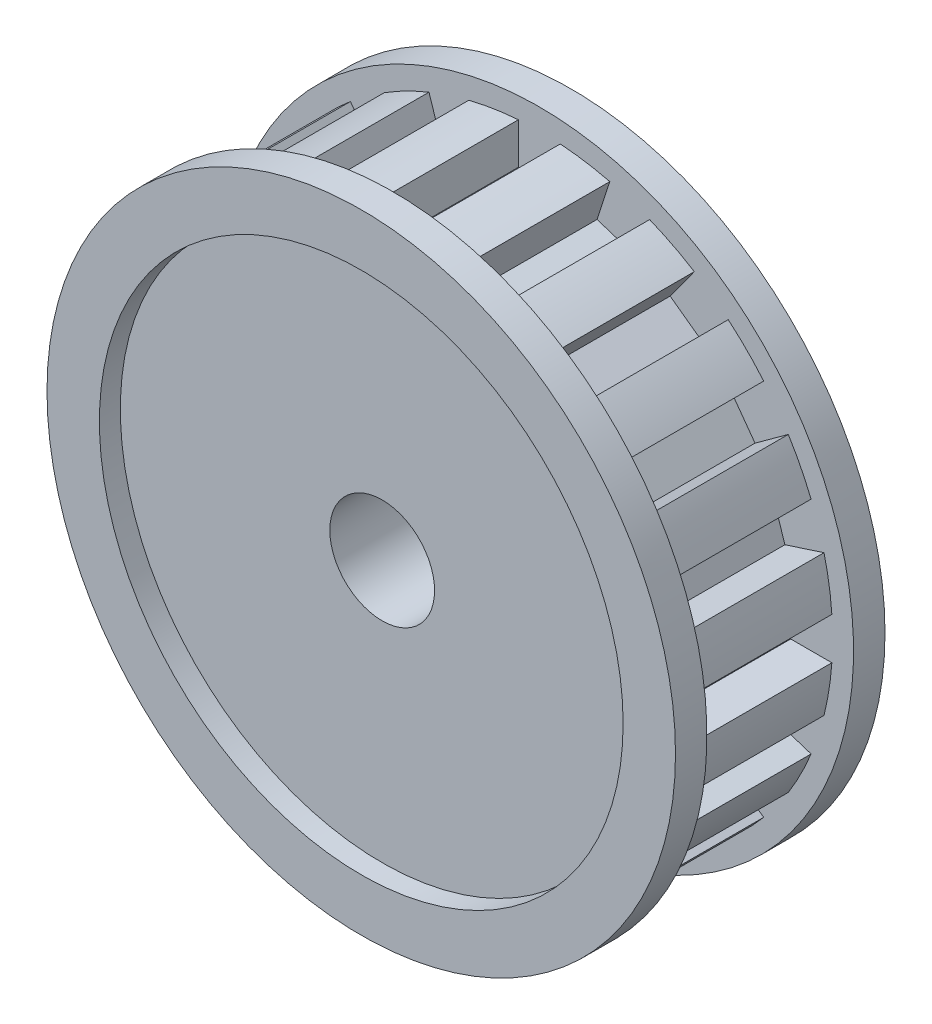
ISO-10303-21;
HEADER;
FILE_DESCRIPTION(('STEP AP214'),'2;1');
FILE_NAME('part.step','',(''),(''),'','','');
FILE_SCHEMA(('AUTOMOTIVE_DESIGN { 1 0 10303 214 1 1 1 1 }'));
ENDSEC;
DATA;
#1=APPLICATION_CONTEXT('core data for automotive mechanical design processes');
#2=APPLICATION_PROTOCOL_DEFINITION('international standard','automotive_design',2000,#1);
#3=PRODUCT_CONTEXT('',#1,'mechanical');
#4=PRODUCT('Part','Part','',(#3));
#5=PRODUCT_RELATED_PRODUCT_CATEGORY('part','',(#4));
#6=PRODUCT_DEFINITION_FORMATION('','',#4);
#7=PRODUCT_DEFINITION_CONTEXT('part definition',#1,'design');
#8=PRODUCT_DEFINITION('design','',#6,#7);
#9=PRODUCT_DEFINITION_SHAPE('','',#8);
#10=(LENGTH_UNIT() NAMED_UNIT(*) SI_UNIT(.MILLI.,.METRE.));
#11=(NAMED_UNIT(*) PLANE_ANGLE_UNIT() SI_UNIT($,.RADIAN.));
#12=(NAMED_UNIT(*) SI_UNIT($,.STERADIAN.) SOLID_ANGLE_UNIT());
#13=UNCERTAINTY_MEASURE_WITH_UNIT(LENGTH_MEASURE(1.E-05),#10,'distance_accuracy_value','');
#14=(GEOMETRIC_REPRESENTATION_CONTEXT(3) GLOBAL_UNCERTAINTY_ASSIGNED_CONTEXT((#13)) GLOBAL_UNIT_ASSIGNED_CONTEXT((#10,
#11,#12)) REPRESENTATION_CONTEXT('',''));
#15=CARTESIAN_POINT('',(0.,0.,0.));
#16=DIRECTION('',(0.,0.,1.));
#17=DIRECTION('',(1.,0.,0.));
#18=AXIS2_PLACEMENT_3D('',#15,#16,#17);
#19=CARTESIAN_POINT('',(0.,0.,10.));
#20=DIRECTION('',(0.,0.,-1.));
#21=DIRECTION('',(-1.,0.,0.));
#22=AXIS2_PLACEMENT_3D('',#19,#20,#21);
#23=CYLINDRICAL_SURFACE('',#22,15.);
#24=CARTESIAN_POINT('',(0.,0.,0.));
#25=DIRECTION('',(0.,0.,1.));
#26=DIRECTION('',(1.,0.,0.));
#27=AXIS2_PLACEMENT_3D('',#24,#25,#26);
#28=CIRCLE('',#27,15.);
#29=CARTESIAN_POINT('',(15.,0.,0.));
#30=VERTEX_POINT('',#29);
#31=EDGE_CURVE('E1299',#30,#30,#28,.T.);
#32=ORIENTED_EDGE('',*,*,#31,.T.);
#33=EDGE_LOOP('',(#32));
#34=FACE_BOUND('',#33,.T.);
#35=CARTESIAN_POINT('',(0.,0.,1.5));
#36=DIRECTION('',(0.,0.,-1.));
#37=DIRECTION('',(-1.,0.,0.));
#38=AXIS2_PLACEMENT_3D('',#35,#36,#37);
#39=CIRCLE('',#38,15.);
#40=CARTESIAN_POINT('',(-15.,0.,1.5));
#41=VERTEX_POINT('',#40);
#42=EDGE_CURVE('E12',#41,#41,#39,.T.);
#43=ORIENTED_EDGE('',*,*,#42,.T.);
#44=EDGE_LOOP('',(#43));
#45=FACE_BOUND('',#44,.T.);
#46=ADVANCED_FACE('F332',(#34,#45),#23,.T.);
#47=CARTESIAN_POINT('',(6.51336241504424,16.8100002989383,1.5));
#48=DIRECTION('',(-0.951056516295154,0.309016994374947,0.));
#49=DIRECTION('',(-0.309016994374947,-0.951056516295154,0.));
#50=AXIS2_PLACEMENT_3D('',#47,#48,#49);
#51=PLANE('',#50);
#52=DIRECTION('',(-0.309016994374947,-0.951056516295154,0.));
#53=VECTOR('',#52,1.);
#54=CARTESIAN_POINT('',(6.51336241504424,16.8100002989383,8.5));
#55=LINE('',#54,#53);
#56=CARTESIAN_POINT('',(5.26624400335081,12.9717644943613,8.5));
#57=VERTEX_POINT('',#56);
#58=CARTESIAN_POINT('',(4.65926044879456,11.1036612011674,8.5));
#59=VERTEX_POINT('',#58);
#60=EDGE_CURVE('E1237',#57,#59,#55,.T.);
#61=ORIENTED_EDGE('',*,*,#60,.F.);
#62=DIRECTION('',(0.,0.,1.));
#63=VECTOR('',#62,1.);
#64=CARTESIAN_POINT('',(5.26624400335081,12.9717644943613,1.5));
#65=LINE('',#64,#63);
#66=CARTESIAN_POINT('',(5.26624400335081,12.9717644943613,1.5));
#67=VERTEX_POINT('',#66);
#68=EDGE_CURVE('E1519',#57,#67,#65,.F.);
#69=ORIENTED_EDGE('',*,*,#68,.T.);
#70=DIRECTION('',(-0.309016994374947,-0.951056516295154,0.));
#71=VECTOR('',#70,1.);
#72=CARTESIAN_POINT('',(6.51336241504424,16.8100002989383,1.5));
#73=LINE('',#72,#71);
#74=CARTESIAN_POINT('',(4.65926044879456,11.1036612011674,1.5));
#75=VERTEX_POINT('',#74);
#76=EDGE_CURVE('E1272',#67,#75,#73,.T.);
#77=ORIENTED_EDGE('',*,*,#76,.T.);
#78=DIRECTION('',(0.,0.,1.));
#79=VECTOR('',#78,1.);
#80=CARTESIAN_POINT('',(4.65926044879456,11.1036612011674,1.5));
#81=LINE('',#80,#79);
#82=EDGE_CURVE('E1295',#75,#59,#81,.T.);
#83=ORIENTED_EDGE('',*,*,#82,.T.);
#84=EDGE_LOOP('',(#61,#69,#77,#83));
#85=FACE_BOUND('',#84,.T.);
#86=ADVANCED_FACE('F1335',(#85),#51,.T.);
#87=CARTESIAN_POINT('',(4.61124938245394,17.4280342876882,1.5));
#88=DIRECTION('',(-0.951056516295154,0.309016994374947,0.));
#89=DIRECTION('',(-0.309016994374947,-0.951056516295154,0.));
#90=AXIS2_PLACEMENT_3D('',#87,#88,#89);
#91=PLANE('',#90);
#92=DIRECTION('',(0.,0.,1.));
#93=VECTOR('',#92,1.);
#94=CARTESIAN_POINT('',(3.3641309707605,13.5897984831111,1.5));
#95=LINE('',#94,#93);
#96=CARTESIAN_POINT('',(3.3641309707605,13.5897984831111,8.5));
#97=VERTEX_POINT('',#96);
#98=CARTESIAN_POINT('',(3.3641309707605,13.5897984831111,1.5));
#99=VERTEX_POINT('',#98);
#100=EDGE_CURVE('E1528',#97,#99,#95,.F.);
#101=ORIENTED_EDGE('',*,*,#100,.F.);
#102=DIRECTION('',(-0.309016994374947,-0.951056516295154,0.));
#103=VECTOR('',#102,1.);
#104=CARTESIAN_POINT('',(4.61124938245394,17.4280342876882,8.5));
#105=LINE('',#104,#103);
#106=CARTESIAN_POINT('',(2.75714741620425,11.7216951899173,8.5));
#107=VERTEX_POINT('',#106);
#108=EDGE_CURVE('E1276',#97,#107,#105,.T.);
#109=ORIENTED_EDGE('',*,*,#108,.T.);
#110=DIRECTION('',(0.,0.,1.));
#111=VECTOR('',#110,1.);
#112=CARTESIAN_POINT('',(2.75714741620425,11.7216951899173,1.5));
#113=LINE('',#112,#111);
#114=CARTESIAN_POINT('',(2.75714741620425,11.7216951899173,1.5));
#115=VERTEX_POINT('',#114);
#116=EDGE_CURVE('E1283',#115,#107,#113,.T.);
#117=ORIENTED_EDGE('',*,*,#116,.F.);
#118=DIRECTION('',(-0.309016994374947,-0.951056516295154,0.));
#119=VECTOR('',#118,1.);
#120=CARTESIAN_POINT('',(4.61124938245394,17.4280342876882,1.5));
#121=LINE('',#120,#119);
#122=EDGE_CURVE('E1280',#99,#115,#121,.T.);
#123=ORIENTED_EDGE('',*,*,#122,.F.);
#124=EDGE_LOOP('',(#101,#109,#117,#123));
#125=FACE_BOUND('',#124,.T.);
#126=ADVANCED_FACE('F1341',(#125),#91,.F.);
#127=CARTESIAN_POINT('',(15.1500911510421,9.77111754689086,1.5));
#128=DIRECTION('',(-0.587785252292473,0.809016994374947,0.));
#129=DIRECTION('',(-0.809016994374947,-0.587785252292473,0.));
#130=AXIS2_PLACEMENT_3D('',#127,#128,#129);
#131=PLANE('',#130);
#132=DIRECTION('',(-0.809016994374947,-0.587785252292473,0.));
#133=VECTOR('',#132,1.);
#134=CARTESIAN_POINT('',(15.1500911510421,9.77111754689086,8.5));
#135=LINE('',#134,#133);
#136=CARTESIAN_POINT('',(11.8850927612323,7.39895736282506,8.5));
#137=VERTEX_POINT('',#136);
#138=CARTESIAN_POINT('',(10.2959891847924,6.24440603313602,8.5));
#139=VERTEX_POINT('',#138);
#140=EDGE_CURVE('E1610',#137,#139,#135,.T.);
#141=ORIENTED_EDGE('',*,*,#140,.F.);
#142=DIRECTION('',(0.,0.,1.));
#143=VECTOR('',#142,1.);
#144=CARTESIAN_POINT('',(11.8850927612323,7.39895736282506,1.5));
#145=LINE('',#144,#143);
#146=CARTESIAN_POINT('',(11.8850927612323,7.39895736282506,1.5));
#147=VERTEX_POINT('',#146);
#148=EDGE_CURVE('E1531',#137,#147,#145,.F.);
#149=ORIENTED_EDGE('',*,*,#148,.T.);
#150=DIRECTION('',(-0.809016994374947,-0.587785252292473,0.));
#151=VECTOR('',#150,1.);
#152=CARTESIAN_POINT('',(15.1500911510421,9.77111754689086,1.5));
#153=LINE('',#152,#151);
#154=CARTESIAN_POINT('',(10.2959891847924,6.24440603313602,1.5));
#155=VERTEX_POINT('',#154);
#156=EDGE_CURVE('E1606',#147,#155,#153,.T.);
#157=ORIENTED_EDGE('',*,*,#156,.T.);
#158=DIRECTION('',(0.,0.,1.));
#159=VECTOR('',#158,1.);
#160=CARTESIAN_POINT('',(10.2959891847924,6.24440603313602,1.5));
#161=LINE('',#160,#159);
#162=EDGE_CURVE('E1585',#155,#139,#161,.T.);
#163=ORIENTED_EDGE('',*,*,#162,.T.);
#164=EDGE_LOOP('',(#141,#149,#157,#163));
#165=FACE_BOUND('',#164,.T.);
#166=ADVANCED_FACE('F1497',(#165),#131,.T.);
#167=CARTESIAN_POINT('',(13.9745206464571,11.3891515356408,1.5));
#168=DIRECTION('',(-0.587785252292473,0.809016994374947,0.));
#169=DIRECTION('',(-0.809016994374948,-0.587785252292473,0.));
#170=AXIS2_PLACEMENT_3D('',#167,#168,#169);
#171=PLANE('',#170);
#172=DIRECTION('',(0.,0.,1.));
#173=VECTOR('',#172,1.);
#174=CARTESIAN_POINT('',(10.7095222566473,9.01699135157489,1.5));
#175=LINE('',#174,#173);
#176=CARTESIAN_POINT('',(10.7095222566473,9.01699135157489,8.5));
#177=VERTEX_POINT('',#176);
#178=CARTESIAN_POINT('',(10.7095222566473,9.01699135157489,1.5));
#179=VERTEX_POINT('',#178);
#180=EDGE_CURVE('E1538',#177,#179,#175,.F.);
#181=ORIENTED_EDGE('',*,*,#180,.F.);
#182=DIRECTION('',(-0.809016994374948,-0.587785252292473,0.));
#183=VECTOR('',#182,1.);
#184=CARTESIAN_POINT('',(13.9745206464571,11.3891515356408,8.5));
#185=LINE('',#184,#183);
#186=CARTESIAN_POINT('',(9.12041868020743,7.86244002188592,8.5));
#187=VERTEX_POINT('',#186);
#188=EDGE_CURVE('E1602',#177,#187,#185,.T.);
#189=ORIENTED_EDGE('',*,*,#188,.T.);
#190=DIRECTION('',(0.,0.,1.));
#191=VECTOR('',#190,1.);
#192=CARTESIAN_POINT('',(9.12041868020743,7.86244002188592,1.5));
#193=LINE('',#192,#191);
#194=CARTESIAN_POINT('',(9.12041868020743,7.86244002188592,1.5));
#195=VERTEX_POINT('',#194);
#196=EDGE_CURVE('E1597',#195,#187,#193,.T.);
#197=ORIENTED_EDGE('',*,*,#196,.F.);
#198=DIRECTION('',(-0.809016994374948,-0.587785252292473,0.));
#199=VECTOR('',#198,1.);
#200=CARTESIAN_POINT('',(13.9745206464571,11.3891515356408,1.5));
#201=LINE('',#200,#199);
#202=EDGE_CURVE('E1601',#179,#195,#201,.T.);
#203=ORIENTED_EDGE('',*,*,#202,.F.);
#204=EDGE_LOOP('',(#181,#189,#197,#203));
#205=FACE_BOUND('',#204,.T.);
#206=ADVANCED_FACE('F1816',(#205),#171,.F.);
#207=CARTESIAN_POINT('',(17.4280342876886,4.61124938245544,1.5));
#208=DIRECTION('',(-0.309016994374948,0.951056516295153,0.));
#209=DIRECTION('',(-0.951056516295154,-0.309016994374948,0.));
#210=AXIS2_PLACEMENT_3D('',#207,#208,#209);
#211=PLANE('',#210);
#212=DIRECTION('',(-0.951056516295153,-0.309016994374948,0.));
#213=VECTOR('',#212,1.);
#214=CARTESIAN_POINT('',(17.4280342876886,4.61124938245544,8.5));
#215=LINE('',#214,#213);
#216=CARTESIAN_POINT('',(13.5897984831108,3.36413097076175,8.5));
#217=VERTEX_POINT('',#216);
#218=CARTESIAN_POINT('',(11.7216951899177,2.75714741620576,8.5));
#219=VERTEX_POINT('',#218);
#220=EDGE_CURVE('E1637',#217,#219,#215,.T.);
#221=ORIENTED_EDGE('',*,*,#220,.F.);
#222=DIRECTION('',(0.,0.,1.));
#223=VECTOR('',#222,1.);
#224=CARTESIAN_POINT('',(13.5897984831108,3.36413097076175,1.5));
#225=LINE('',#224,#223);
#226=CARTESIAN_POINT('',(13.5897984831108,3.36413097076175,1.5));
#227=VERTEX_POINT('',#226);
#228=EDGE_CURVE('E1803',#217,#227,#225,.F.);
#229=ORIENTED_EDGE('',*,*,#228,.T.);
#230=DIRECTION('',(-0.951056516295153,-0.309016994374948,0.));
#231=VECTOR('',#230,1.);
#232=CARTESIAN_POINT('',(17.4280342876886,4.61124938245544,1.5));
#233=LINE('',#232,#231);
#234=CARTESIAN_POINT('',(11.7216951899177,2.75714741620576,1.5));
#235=VERTEX_POINT('',#234);
#236=EDGE_CURVE('E852',#227,#235,#233,.T.);
#237=ORIENTED_EDGE('',*,*,#236,.T.);
#238=DIRECTION('',(0.,0.,1.));
#239=VECTOR('',#238,1.);
#240=CARTESIAN_POINT('',(11.7216951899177,2.75714741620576,1.5));
#241=LINE('',#240,#239);
#242=EDGE_CURVE('E1613',#235,#219,#241,.T.);
#243=ORIENTED_EDGE('',*,*,#242,.T.);
#244=EDGE_LOOP('',(#221,#229,#237,#243));
#245=FACE_BOUND('',#244,.T.);
#246=ADVANCED_FACE('F2173',(#245),#211,.T.);
#247=CARTESIAN_POINT('',(16.8100002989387,6.51336241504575,1.5));
#248=DIRECTION('',(-0.309016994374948,0.951056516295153,0.));
#249=DIRECTION('',(-0.951056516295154,-0.309016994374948,0.));
#250=AXIS2_PLACEMENT_3D('',#247,#248,#249);
#251=PLANE('',#250);
#252=DIRECTION('',(0.,0.,1.));
#253=VECTOR('',#252,1.);
#254=CARTESIAN_POINT('',(12.9717644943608,5.26624400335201,1.5));
#255=LINE('',#254,#253);
#256=CARTESIAN_POINT('',(12.9717644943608,5.26624400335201,8.5));
#257=VERTEX_POINT('',#256);
#258=CARTESIAN_POINT('',(12.9717644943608,5.26624400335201,1.5));
#259=VERTEX_POINT('',#258);
#260=EDGE_CURVE('E1800',#257,#259,#255,.F.);
#261=ORIENTED_EDGE('',*,*,#260,.F.);
#262=DIRECTION('',(-0.951056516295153,-0.309016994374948,0.));
#263=VECTOR('',#262,1.);
#264=CARTESIAN_POINT('',(16.8100002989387,6.51336241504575,8.5));
#265=LINE('',#264,#263);
#266=CARTESIAN_POINT('',(11.1036612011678,4.65926044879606,8.5));
#267=VERTEX_POINT('',#266);
#268=EDGE_CURVE('E1630',#257,#267,#265,.T.);
#269=ORIENTED_EDGE('',*,*,#268,.T.);
#270=DIRECTION('',(0.,0.,1.));
#271=VECTOR('',#270,1.);
#272=CARTESIAN_POINT('',(11.1036612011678,4.65926044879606,1.5));
#273=LINE('',#272,#271);
#274=CARTESIAN_POINT('',(11.1036612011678,4.65926044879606,1.5));
#275=VERTEX_POINT('',#274);
#276=EDGE_CURVE('E1625',#275,#267,#273,.T.);
#277=ORIENTED_EDGE('',*,*,#276,.F.);
#278=DIRECTION('',(-0.951056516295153,-0.309016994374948,0.));
#279=VECTOR('',#278,1.);
#280=CARTESIAN_POINT('',(16.8100002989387,6.51336241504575,1.5));
#281=LINE('',#280,#279);
#282=EDGE_CURVE('E1629',#259,#275,#281,.T.);
#283=ORIENTED_EDGE('',*,*,#282,.F.);
#284=EDGE_LOOP('',(#261,#269,#277,#283));
#285=FACE_BOUND('',#284,.T.);
#286=ADVANCED_FACE('F2161',(#285),#251,.F.);
#287=CARTESIAN_POINT('',(11.3891515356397,13.9745206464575,1.5));
#288=DIRECTION('',(-0.809016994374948,0.587785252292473,0.));
#289=DIRECTION('',(-0.587785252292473,-0.809016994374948,0.));
#290=AXIS2_PLACEMENT_3D('',#287,#288,#289);
#291=PLANE('',#290);
#292=DIRECTION('',(-0.587785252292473,-0.809016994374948,0.));
#293=VECTOR('',#292,1.);
#294=CARTESIAN_POINT('',(11.3891515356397,13.9745206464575,8.5));
#295=LINE('',#294,#293);
#296=CARTESIAN_POINT('',(9.01699135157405,10.709522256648,8.5));
#297=VERTEX_POINT('',#296);
#298=CARTESIAN_POINT('',(7.86244002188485,9.12041868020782,8.5));
#299=VERTEX_POINT('',#298);
#300=EDGE_CURVE('E1582',#297,#299,#295,.T.);
#301=ORIENTED_EDGE('',*,*,#300,.F.);
#302=DIRECTION('',(0.,0.,1.));
#303=VECTOR('',#302,1.);
#304=CARTESIAN_POINT('',(9.01699135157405,10.709522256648,1.5));
#305=LINE('',#304,#303);
#306=CARTESIAN_POINT('',(9.01699135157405,10.709522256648,1.5));
#307=VERTEX_POINT('',#306);
#308=EDGE_CURVE('E1797',#297,#307,#305,.F.);
#309=ORIENTED_EDGE('',*,*,#308,.T.);
#310=DIRECTION('',(-0.587785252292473,-0.809016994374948,0.));
#311=VECTOR('',#310,1.);
#312=CARTESIAN_POINT('',(11.3891515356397,13.9745206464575,1.5));
#313=LINE('',#312,#311);
#314=CARTESIAN_POINT('',(7.86244002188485,9.12041868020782,1.5));
#315=VERTEX_POINT('',#314);
#316=EDGE_CURVE('E1578',#307,#315,#313,.T.);
#317=ORIENTED_EDGE('',*,*,#316,.T.);
#318=DIRECTION('',(0.,0.,1.));
#319=VECTOR('',#318,1.);
#320=CARTESIAN_POINT('',(7.86244002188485,9.12041868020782,1.5));
#321=LINE('',#320,#319);
#322=EDGE_CURVE('E1562',#315,#299,#321,.T.);
#323=ORIENTED_EDGE('',*,*,#322,.T.);
#324=EDGE_LOOP('',(#301,#309,#317,#323));
#325=FACE_BOUND('',#324,.T.);
#326=ADVANCED_FACE('F2158',(#325),#291,.T.);
#327=CARTESIAN_POINT('',(9.77111754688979,15.1500911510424,1.5));
#328=DIRECTION('',(-0.809016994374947,0.587785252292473,0.));
#329=DIRECTION('',(-0.587785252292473,-0.809016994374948,0.));
#330=AXIS2_PLACEMENT_3D('',#327,#328,#329);
#331=PLANE('',#330);
#332=DIRECTION('',(0.,0.,1.));
#333=VECTOR('',#332,1.);
#334=CARTESIAN_POINT('',(7.39895736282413,11.8850927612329,1.5));
#335=LINE('',#334,#333);
#336=CARTESIAN_POINT('',(7.39895736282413,11.8850927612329,8.5));
#337=VERTEX_POINT('',#336);
#338=CARTESIAN_POINT('',(7.39895736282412,11.8850927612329,1.5));
#339=VERTEX_POINT('',#338);
#340=EDGE_CURVE('E1794',#337,#339,#335,.F.);
#341=ORIENTED_EDGE('',*,*,#340,.F.);
#342=DIRECTION('',(-0.587785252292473,-0.809016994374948,0.));
#343=VECTOR('',#342,1.);
#344=CARTESIAN_POINT('',(9.77111754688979,15.1500911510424,8.5));
#345=LINE('',#344,#343);
#346=CARTESIAN_POINT('',(6.24440603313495,10.2959891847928,8.5));
#347=VERTEX_POINT('',#346);
#348=EDGE_CURVE('E1574',#337,#347,#345,.T.);
#349=ORIENTED_EDGE('',*,*,#348,.T.);
#350=DIRECTION('',(0.,0.,1.));
#351=VECTOR('',#350,1.);
#352=CARTESIAN_POINT('',(6.24440603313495,10.2959891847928,1.5));
#353=LINE('',#352,#351);
#354=CARTESIAN_POINT('',(6.24440603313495,10.2959891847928,1.5));
#355=VERTEX_POINT('',#354);
#356=EDGE_CURVE('E1569',#355,#347,#353,.T.);
#357=ORIENTED_EDGE('',*,*,#356,.F.);
#358=DIRECTION('',(-0.587785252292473,-0.809016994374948,0.));
#359=VECTOR('',#358,1.);
#360=CARTESIAN_POINT('',(9.77111754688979,15.1500911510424,1.5));
#361=LINE('',#360,#359);
#362=EDGE_CURVE('E1573',#339,#355,#361,.T.);
#363=ORIENTED_EDGE('',*,*,#362,.F.);
#364=EDGE_LOOP('',(#341,#349,#357,#363));
#365=FACE_BOUND('',#364,.T.);
#366=ADVANCED_FACE('F1438',(#365),#331,.F.);
#367=CARTESIAN_POINT('',(-17.4280342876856,-4.6112493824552,1.5));
#368=DIRECTION('',(0.309016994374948,-0.951056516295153,0.));
#369=DIRECTION('',(0.951056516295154,0.309016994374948,0.));
#370=AXIS2_PLACEMENT_3D('',#367,#368,#369);
#371=PLANE('',#370);
#372=DIRECTION('',(0.951056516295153,0.309016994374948,0.));
#373=VECTOR('',#372,1.);
#374=CARTESIAN_POINT('',(-17.4280342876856,-4.6112493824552,8.5));
#375=LINE('',#374,#373);
#376=CARTESIAN_POINT('',(-13.5897984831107,-3.36413097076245,8.5));
#377=VERTEX_POINT('',#376);
#378=CARTESIAN_POINT('',(-11.7216951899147,-2.75714741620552,8.5));
#379=VERTEX_POINT('',#378);
#380=EDGE_CURVE('E1083',#377,#379,#375,.T.);
#381=ORIENTED_EDGE('',*,*,#380,.F.);
#382=DIRECTION('',(0.,0.,1.));
#383=VECTOR('',#382,1.);
#384=CARTESIAN_POINT('',(-13.5897984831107,-3.36413097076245,1.5));
#385=LINE('',#384,#383);
#386=CARTESIAN_POINT('',(-13.5897984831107,-3.36413097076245,1.5));
#387=VERTEX_POINT('',#386);
#388=EDGE_CURVE('E1790',#377,#387,#385,.F.);
#389=ORIENTED_EDGE('',*,*,#388,.T.);
#390=DIRECTION('',(0.951056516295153,0.309016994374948,0.));
#391=VECTOR('',#390,1.);
#392=CARTESIAN_POINT('',(-17.4280342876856,-4.6112493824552,1.5));
#393=LINE('',#392,#391);
#394=CARTESIAN_POINT('',(-11.7216951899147,-2.75714741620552,1.5));
#395=VERTEX_POINT('',#394);
#396=EDGE_CURVE('E1146',#387,#395,#393,.T.);
#397=ORIENTED_EDGE('',*,*,#396,.T.);
#398=DIRECTION('',(0.,0.,1.));
#399=VECTOR('',#398,1.);
#400=CARTESIAN_POINT('',(-11.7216951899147,-2.75714741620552,1.5));
#401=LINE('',#400,#399);
#402=EDGE_CURVE('E1125',#395,#379,#401,.T.);
#403=ORIENTED_EDGE('',*,*,#402,.T.);
#404=EDGE_LOOP('',(#381,#389,#397,#403));
#405=FACE_BOUND('',#404,.T.);
#406=ADVANCED_FACE('F1435',(#405),#371,.T.);
#407=CARTESIAN_POINT('',(-16.8100002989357,-6.51336241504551,1.5));
#408=DIRECTION('',(0.309016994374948,-0.951056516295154,0.));
#409=DIRECTION('',(0.951056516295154,0.309016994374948,0.));
#410=AXIS2_PLACEMENT_3D('',#407,#408,#409);
#411=PLANE('',#410);
#412=DIRECTION('',(0.,0.,1.));
#413=VECTOR('',#412,1.);
#414=CARTESIAN_POINT('',(-12.9717644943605,-5.26624400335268,1.5));
#415=LINE('',#414,#413);
#416=CARTESIAN_POINT('',(-12.9717644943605,-5.26624400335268,8.5));
#417=VERTEX_POINT('',#416);
#418=CARTESIAN_POINT('',(-12.9717644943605,-5.26624400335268,1.5));
#419=VERTEX_POINT('',#418);
#420=EDGE_CURVE('E1787',#417,#419,#415,.F.);
#421=ORIENTED_EDGE('',*,*,#420,.F.);
#422=DIRECTION('',(0.951056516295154,0.309016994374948,0.));
#423=VECTOR('',#422,1.);
#424=CARTESIAN_POINT('',(-16.8100002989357,-6.51336241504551,8.5));
#425=LINE('',#424,#423);
#426=CARTESIAN_POINT('',(-11.1036612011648,-4.65926044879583,8.5));
#427=VERTEX_POINT('',#426);
#428=EDGE_CURVE('E1142',#417,#427,#425,.T.);
#429=ORIENTED_EDGE('',*,*,#428,.T.);
#430=DIRECTION('',(0.,0.,1.));
#431=VECTOR('',#430,1.);
#432=CARTESIAN_POINT('',(-11.1036612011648,-4.65926044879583,1.5));
#433=LINE('',#432,#431);
#434=CARTESIAN_POINT('',(-11.1036612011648,-4.65926044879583,1.5));
#435=VERTEX_POINT('',#434);
#436=EDGE_CURVE('E1137',#435,#427,#433,.T.);
#437=ORIENTED_EDGE('',*,*,#436,.F.);
#438=DIRECTION('',(0.951056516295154,0.309016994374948,0.));
#439=VECTOR('',#438,1.);
#440=CARTESIAN_POINT('',(-16.8100002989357,-6.51336241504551,1.5));
#441=LINE('',#440,#439);
#442=EDGE_CURVE('E1141',#419,#435,#441,.T.);
#443=ORIENTED_EDGE('',*,*,#442,.F.);
#444=EDGE_LOOP('',(#421,#429,#437,#443));
#445=FACE_BOUND('',#444,.T.);
#446=ADVANCED_FACE('F1426',(#445),#411,.F.);
#447=CARTESIAN_POINT('',(-15.150091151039,-9.77111754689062,1.5));
#448=DIRECTION('',(0.587785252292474,-0.809016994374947,0.));
#449=DIRECTION('',(0.809016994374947,0.587785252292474,0.));
#450=AXIS2_PLACEMENT_3D('',#447,#448,#449);
#451=PLANE('',#450);
#452=DIRECTION('',(0.809016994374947,0.587785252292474,0.));
#453=VECTOR('',#452,1.);
#454=CARTESIAN_POINT('',(-15.150091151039,-9.77111754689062,8.5));
#455=LINE('',#454,#453);
#456=CARTESIAN_POINT('',(-11.8850927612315,-7.39895736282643,8.5));
#457=VERTEX_POINT('',#456);
#458=CARTESIAN_POINT('',(-10.2959891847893,-6.24440603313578,8.5));
#459=VERTEX_POINT('',#458);
#460=EDGE_CURVE('E1122',#457,#459,#455,.T.);
#461=ORIENTED_EDGE('',*,*,#460,.F.);
#462=DIRECTION('',(0.,0.,1.));
#463=VECTOR('',#462,1.);
#464=CARTESIAN_POINT('',(-11.8850927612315,-7.39895736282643,1.5));
#465=LINE('',#464,#463);
#466=CARTESIAN_POINT('',(-11.8850927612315,-7.39895736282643,1.5));
#467=VERTEX_POINT('',#466);
#468=EDGE_CURVE('E1783',#457,#467,#465,.F.);
#469=ORIENTED_EDGE('',*,*,#468,.T.);
#470=DIRECTION('',(0.809016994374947,0.587785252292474,0.));
#471=VECTOR('',#470,1.);
#472=CARTESIAN_POINT('',(-15.150091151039,-9.77111754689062,1.5));
#473=LINE('',#472,#471);
#474=CARTESIAN_POINT('',(-10.2959891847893,-6.24440603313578,1.5));
#475=VERTEX_POINT('',#474);
#476=EDGE_CURVE('E1118',#467,#475,#473,.T.);
#477=ORIENTED_EDGE('',*,*,#476,.T.);
#478=DIRECTION('',(0.,0.,1.));
#479=VECTOR('',#478,1.);
#480=CARTESIAN_POINT('',(-10.2959891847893,-6.24440603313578,1.5));
#481=LINE('',#480,#479);
#482=EDGE_CURVE('E985',#475,#459,#481,.T.);
#483=ORIENTED_EDGE('',*,*,#482,.T.);
#484=EDGE_LOOP('',(#461,#469,#477,#483));
#485=FACE_BOUND('',#484,.T.);
#486=ADVANCED_FACE('F1423',(#485),#451,.T.);
#487=CARTESIAN_POINT('',(-13.974520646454,-11.3891515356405,1.5));
#488=DIRECTION('',(0.587785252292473,-0.809016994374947,0.));
#489=DIRECTION('',(0.809016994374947,0.587785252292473,0.));
#490=AXIS2_PLACEMENT_3D('',#487,#488,#489);
#491=PLANE('',#490);
#492=DIRECTION('',(0.,0.,1.));
#493=VECTOR('',#492,1.);
#494=CARTESIAN_POINT('',(-10.7095222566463,-9.01699135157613,1.5));
#495=LINE('',#494,#493);
#496=CARTESIAN_POINT('',(-10.7095222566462,-9.01699135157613,8.5));
#497=VERTEX_POINT('',#496);
#498=CARTESIAN_POINT('',(-10.7095222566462,-9.01699135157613,1.5));
#499=VERTEX_POINT('',#498);
#500=EDGE_CURVE('E1780',#497,#499,#495,.F.);
#501=ORIENTED_EDGE('',*,*,#500,.F.);
#502=DIRECTION('',(0.809016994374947,0.587785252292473,0.));
#503=VECTOR('',#502,1.);
#504=CARTESIAN_POINT('',(-13.974520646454,-11.3891515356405,8.5));
#505=LINE('',#504,#503);
#506=CARTESIAN_POINT('',(-9.12041868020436,-7.86244002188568,8.5));
#507=VERTEX_POINT('',#506);
#508=EDGE_CURVE('E1114',#497,#507,#505,.T.);
#509=ORIENTED_EDGE('',*,*,#508,.T.);
#510=DIRECTION('',(0.,0.,1.));
#511=VECTOR('',#510,1.);
#512=CARTESIAN_POINT('',(-9.12041868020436,-7.86244002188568,1.5));
#513=LINE('',#512,#511);
#514=CARTESIAN_POINT('',(-9.12041868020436,-7.86244002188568,1.5));
#515=VERTEX_POINT('',#514);
#516=EDGE_CURVE('E1109',#515,#507,#513,.T.);
#517=ORIENTED_EDGE('',*,*,#516,.F.);
#518=DIRECTION('',(0.809016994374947,0.587785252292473,0.));
#519=VECTOR('',#518,1.);
#520=CARTESIAN_POINT('',(-13.974520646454,-11.3891515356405,1.5));
#521=LINE('',#520,#519);
#522=EDGE_CURVE('E1113',#499,#515,#521,.T.);
#523=ORIENTED_EDGE('',*,*,#522,.F.);
#524=EDGE_LOOP('',(#501,#509,#517,#523));
#525=FACE_BOUND('',#524,.T.);
#526=ADVANCED_FACE('F1414',(#525),#491,.F.);
#527=CARTESIAN_POINT('',(-17.9999999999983,0.999999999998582,1.5));
#528=DIRECTION('',(0.,-1.,0.));
#529=DIRECTION('',(1.,0.,0.));
#530=AXIS2_PLACEMENT_3D('',#527,#528,#529);
#531=PLANE('',#530);
#532=DIRECTION('',(1.,0.,0.));
#533=VECTOR('',#532,1.);
#534=CARTESIAN_POINT('',(-17.9999999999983,0.999999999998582,8.5));
#535=LINE('',#534,#533);
#536=CARTESIAN_POINT('',(-13.964240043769,0.999999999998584,8.5));
#537=VERTEX_POINT('',#536);
#538=CARTESIAN_POINT('',(-11.9999999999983,0.999999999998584,8.5));
#539=VERTEX_POINT('',#538);
#540=EDGE_CURVE('E1053',#537,#539,#535,.T.);
#541=ORIENTED_EDGE('',*,*,#540,.F.);
#542=DIRECTION('',(0.,0.,1.));
#543=VECTOR('',#542,1.);
#544=CARTESIAN_POINT('',(-13.964240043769,0.999999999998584,1.5));
#545=LINE('',#544,#543);
#546=CARTESIAN_POINT('',(-13.964240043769,0.999999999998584,1.5));
#547=VERTEX_POINT('',#546);
#548=EDGE_CURVE('E1776',#537,#547,#545,.F.);
#549=ORIENTED_EDGE('',*,*,#548,.T.);
#550=DIRECTION('',(1.,0.,0.));
#551=VECTOR('',#550,1.);
#552=CARTESIAN_POINT('',(-17.9999999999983,0.999999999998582,1.5));
#553=LINE('',#552,#551);
#554=CARTESIAN_POINT('',(-11.9999999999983,0.999999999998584,1.5));
#555=VERTEX_POINT('',#554);
#556=EDGE_CURVE('E1092',#547,#555,#553,.T.);
#557=ORIENTED_EDGE('',*,*,#556,.T.);
#558=DIRECTION('',(0.,0.,1.));
#559=VECTOR('',#558,1.);
#560=CARTESIAN_POINT('',(-11.9999999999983,0.999999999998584,1.5));
#561=LINE('',#560,#559);
#562=EDGE_CURVE('E1078',#555,#539,#561,.T.);
#563=ORIENTED_EDGE('',*,*,#562,.T.);
#564=EDGE_LOOP('',(#541,#549,#557,#563));
#565=FACE_BOUND('',#564,.T.);
#566=ADVANCED_FACE('F1411',(#565),#531,.T.);
#567=CARTESIAN_POINT('',(-17.9999999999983,-1.00000000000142,1.5));
#568=DIRECTION('',(0.,-1.,0.));
#569=DIRECTION('',(1.,0.,0.));
#570=AXIS2_PLACEMENT_3D('',#567,#568,#569);
#571=PLANE('',#570);
#572=DIRECTION('',(0.,0.,1.));
#573=VECTOR('',#572,1.);
#574=CARTESIAN_POINT('',(-13.9642400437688,-1.00000000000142,1.5));
#575=LINE('',#574,#573);
#576=CARTESIAN_POINT('',(-13.9642400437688,-1.00000000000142,8.5));
#577=VERTEX_POINT('',#576);
#578=CARTESIAN_POINT('',(-13.9642400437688,-1.00000000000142,1.5));
#579=VERTEX_POINT('',#578);
#580=EDGE_CURVE('E1773',#577,#579,#575,.F.);
#581=ORIENTED_EDGE('',*,*,#580,.F.);
#582=DIRECTION('',(1.,0.,0.));
#583=VECTOR('',#582,1.);
#584=CARTESIAN_POINT('',(-17.9999999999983,-1.00000000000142,8.5));
#585=LINE('',#584,#583);
#586=CARTESIAN_POINT('',(-11.9999999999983,-1.00000000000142,8.5));
#587=VERTEX_POINT('',#586);
#588=EDGE_CURVE('E1088',#577,#587,#585,.T.);
#589=ORIENTED_EDGE('',*,*,#588,.T.);
#590=DIRECTION('',(0.,0.,1.));
#591=VECTOR('',#590,1.);
#592=CARTESIAN_POINT('',(-11.9999999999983,-1.00000000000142,1.5));
#593=LINE('',#592,#591);
#594=CARTESIAN_POINT('',(-11.9999999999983,-1.00000000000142,1.5));
#595=VERTEX_POINT('',#594);
#596=EDGE_CURVE('E1082',#595,#587,#593,.T.);
#597=ORIENTED_EDGE('',*,*,#596,.F.);
#598=DIRECTION('',(1.,0.,0.));
#599=VECTOR('',#598,1.);
#600=CARTESIAN_POINT('',(-17.9999999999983,-1.00000000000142,1.5));
#601=LINE('',#600,#599);
#602=EDGE_CURVE('E1087',#579,#595,#601,.T.);
#603=ORIENTED_EDGE('',*,*,#602,.F.);
#604=EDGE_LOOP('',(#581,#589,#597,#603));
#605=FACE_BOUND('',#604,.T.);
#606=ADVANCED_FACE('F1399',(#605),#571,.F.);
#607=CARTESIAN_POINT('',(-16.8100002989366,6.51336241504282,1.5));
#608=DIRECTION('',(-0.309016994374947,-0.951056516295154,0.));
#609=DIRECTION('',(0.951056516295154,-0.309016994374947,0.));
#610=AXIS2_PLACEMENT_3D('',#607,#608,#609);
#611=PLANE('',#610);
#612=DIRECTION('',(0.951056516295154,-0.309016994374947,0.));
#613=VECTOR('',#612,1.);
#614=CARTESIAN_POINT('',(-16.8100002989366,6.51336241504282,8.5));
#615=LINE('',#614,#613);
#616=CARTESIAN_POINT('',(-12.9717644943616,5.26624400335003,8.5));
#617=VERTEX_POINT('',#616);
#618=CARTESIAN_POINT('',(-11.1036612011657,4.65926044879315,8.5));
#619=VERTEX_POINT('',#618);
#620=EDGE_CURVE('E1066',#617,#619,#615,.T.);
#621=ORIENTED_EDGE('',*,*,#620,.F.);
#622=DIRECTION('',(0.,0.,1.));
#623=VECTOR('',#622,1.);
#624=CARTESIAN_POINT('',(-12.9717644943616,5.26624400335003,1.5));
#625=LINE('',#624,#623);
#626=CARTESIAN_POINT('',(-12.9717644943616,5.26624400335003,1.5));
#627=VERTEX_POINT('',#626);
#628=EDGE_CURVE('E1769',#617,#627,#625,.F.);
#629=ORIENTED_EDGE('',*,*,#628,.T.);
#630=DIRECTION('',(0.951056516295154,-0.309016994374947,0.));
#631=VECTOR('',#630,1.);
#632=CARTESIAN_POINT('',(-16.8100002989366,6.51336241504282,1.5));
#633=LINE('',#632,#631);
#634=CARTESIAN_POINT('',(-11.1036612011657,4.65926044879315,1.5));
#635=VERTEX_POINT('',#634);
#636=EDGE_CURVE('E1062',#627,#635,#633,.T.);
#637=ORIENTED_EDGE('',*,*,#636,.T.);
#638=DIRECTION('',(0.,0.,1.));
#639=VECTOR('',#638,1.);
#640=CARTESIAN_POINT('',(-11.1036612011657,4.65926044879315,1.5));
#641=LINE('',#640,#639);
#642=EDGE_CURVE('E1048',#635,#619,#641,.T.);
#643=ORIENTED_EDGE('',*,*,#642,.T.);
#644=EDGE_LOOP('',(#621,#629,#637,#643));
#645=FACE_BOUND('',#644,.T.);
#646=ADVANCED_FACE('F1395',(#645),#611,.T.);
#647=CARTESIAN_POINT('',(-17.4280342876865,4.61124938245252,1.5));
#648=DIRECTION('',(-0.309016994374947,-0.951056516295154,0.));
#649=DIRECTION('',(0.951056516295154,-0.309016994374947,0.));
#650=AXIS2_PLACEMENT_3D('',#647,#648,#649);
#651=PLANE('',#650);
#652=DIRECTION('',(0.,0.,1.));
#653=VECTOR('',#652,1.);
#654=CARTESIAN_POINT('',(-13.5897984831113,3.36413097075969,1.5));
#655=LINE('',#654,#653);
#656=CARTESIAN_POINT('',(-13.5897984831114,3.36413097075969,8.5));
#657=VERTEX_POINT('',#656);
#658=CARTESIAN_POINT('',(-13.5897984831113,3.36413097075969,1.5));
#659=VERTEX_POINT('',#658);
#660=EDGE_CURVE('E1766',#657,#659,#655,.F.);
#661=ORIENTED_EDGE('',*,*,#660,.F.);
#662=DIRECTION('',(0.951056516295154,-0.309016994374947,0.));
#663=VECTOR('',#662,1.);
#664=CARTESIAN_POINT('',(-17.4280342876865,4.61124938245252,8.5));
#665=LINE('',#664,#663);
#666=CARTESIAN_POINT('',(-11.7216951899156,2.75714741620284,8.5));
#667=VERTEX_POINT('',#666);
#668=EDGE_CURVE('E1058',#657,#667,#665,.T.);
#669=ORIENTED_EDGE('',*,*,#668,.T.);
#670=DIRECTION('',(0.,0.,1.));
#671=VECTOR('',#670,1.);
#672=CARTESIAN_POINT('',(-11.7216951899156,2.75714741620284,1.5));
#673=LINE('',#672,#671);
#674=CARTESIAN_POINT('',(-11.7216951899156,2.75714741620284,1.5));
#675=VERTEX_POINT('',#674);
#676=EDGE_CURVE('E1052',#675,#667,#673,.T.);
#677=ORIENTED_EDGE('',*,*,#676,.F.);
#678=DIRECTION('',(0.951056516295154,-0.309016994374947,0.));
#679=VECTOR('',#678,1.);
#680=CARTESIAN_POINT('',(-17.4280342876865,4.61124938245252,1.5));
#681=LINE('',#680,#679);
#682=EDGE_CURVE('E1057',#659,#675,#681,.T.);
#683=ORIENTED_EDGE('',*,*,#682,.F.);
#684=EDGE_LOOP('',(#661,#669,#677,#683));
#685=FACE_BOUND('',#684,.T.);
#686=ADVANCED_FACE('F1398',(#685),#651,.F.);
#687=CARTESIAN_POINT('',(0.999999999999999,18.,1.5));
#688=DIRECTION('',(-1.,0.,0.));
#689=DIRECTION('',(0.,-1.,0.));
#690=AXIS2_PLACEMENT_3D('',#687,#688,#689);
#691=PLANE('',#690);
#692=DIRECTION('',(0.,-1.,0.));
#693=VECTOR('',#692,1.);
#694=CARTESIAN_POINT('',(0.999999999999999,18.,8.5));
#695=LINE('',#694,#693);
#696=CARTESIAN_POINT('',(0.999999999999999,13.9642400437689,8.5));
#697=VERTEX_POINT('',#696);
#698=CARTESIAN_POINT('',(1.,12.,8.5));
#699=VERTEX_POINT('',#698);
#700=EDGE_CURVE('E1234',#697,#699,#695,.T.);
#701=ORIENTED_EDGE('',*,*,#700,.F.);
#702=DIRECTION('',(0.,0.,1.));
#703=VECTOR('',#702,1.);
#704=CARTESIAN_POINT('',(1.,13.9642400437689,1.5));
#705=LINE('',#704,#703);
#706=CARTESIAN_POINT('',(1.,13.9642400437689,1.5));
#707=VERTEX_POINT('',#706);
#708=EDGE_CURVE('E1762',#697,#707,#705,.F.);
#709=ORIENTED_EDGE('',*,*,#708,.T.);
#710=DIRECTION('',(0.,-1.,0.));
#711=VECTOR('',#710,1.);
#712=CARTESIAN_POINT('',(0.999999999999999,18.,1.5));
#713=LINE('',#712,#711);
#714=CARTESIAN_POINT('',(1.,12.,1.5));
#715=VERTEX_POINT('',#714);
#716=EDGE_CURVE('E1230',#707,#715,#713,.T.);
#717=ORIENTED_EDGE('',*,*,#716,.T.);
#718=DIRECTION('',(0.,0.,1.));
#719=VECTOR('',#718,1.);
#720=CARTESIAN_POINT('',(1.,12.,1.5));
#721=LINE('',#720,#719);
#722=EDGE_CURVE('E1216',#715,#699,#721,.T.);
#723=ORIENTED_EDGE('',*,*,#722,.T.);
#724=EDGE_LOOP('',(#701,#709,#717,#723));
#725=FACE_BOUND('',#724,.T.);
#726=ADVANCED_FACE('F1409',(#725),#691,.T.);
#727=CARTESIAN_POINT('',(-1.,18.,1.5));
#728=DIRECTION('',(-1.,0.,0.));
#729=DIRECTION('',(0.,-1.,0.));
#730=AXIS2_PLACEMENT_3D('',#727,#728,#729);
#731=PLANE('',#730);
#732=DIRECTION('',(0.,0.,1.));
#733=VECTOR('',#732,1.);
#734=CARTESIAN_POINT('',(-1.,13.9642400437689,1.5));
#735=LINE('',#734,#733);
#736=CARTESIAN_POINT('',(-1.,13.9642400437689,8.5));
#737=VERTEX_POINT('',#736);
#738=CARTESIAN_POINT('',(-1.,13.9642400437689,1.5));
#739=VERTEX_POINT('',#738);
#740=EDGE_CURVE('E1759',#737,#739,#735,.F.);
#741=ORIENTED_EDGE('',*,*,#740,.F.);
#742=DIRECTION('',(0.,-1.,0.));
#743=VECTOR('',#742,1.);
#744=CARTESIAN_POINT('',(-1.,18.,8.5));
#745=LINE('',#744,#743);
#746=CARTESIAN_POINT('',(-1.,12.,8.5));
#747=VERTEX_POINT('',#746);
#748=EDGE_CURVE('E1226',#737,#747,#745,.T.);
#749=ORIENTED_EDGE('',*,*,#748,.T.);
#750=DIRECTION('',(0.,0.,1.));
#751=VECTOR('',#750,1.);
#752=CARTESIAN_POINT('',(-1.,12.,1.5));
#753=LINE('',#752,#751);
#754=CARTESIAN_POINT('',(-1.,12.,1.5));
#755=VERTEX_POINT('',#754);
#756=EDGE_CURVE('E1220',#755,#747,#753,.T.);
#757=ORIENTED_EDGE('',*,*,#756,.F.);
#758=DIRECTION('',(0.,-1.,0.));
#759=VECTOR('',#758,1.);
#760=CARTESIAN_POINT('',(-1.,18.,1.5));
#761=LINE('',#760,#759);
#762=EDGE_CURVE('E1225',#739,#755,#761,.T.);
#763=ORIENTED_EDGE('',*,*,#762,.F.);
#764=EDGE_LOOP('',(#741,#749,#757,#763));
#765=FACE_BOUND('',#764,.T.);
#766=ADVANCED_FACE('F1477',(#765),#731,.F.);
#767=CARTESIAN_POINT('',(-4.61124938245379,17.4280342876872,1.5));
#768=DIRECTION('',(-0.951056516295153,-0.309016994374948,0.));
#769=DIRECTION('',(0.309016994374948,-0.951056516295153,0.));
#770=AXIS2_PLACEMENT_3D('',#767,#768,#769);
#771=PLANE('',#770);
#772=DIRECTION('',(0.309016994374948,-0.951056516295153,0.));
#773=VECTOR('',#772,1.);
#774=CARTESIAN_POINT('',(-4.61124938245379,17.4280342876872,8.5));
#775=LINE('',#774,#773);
#776=CARTESIAN_POINT('',(-3.36413097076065,13.5897984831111,8.5));
#777=VERTEX_POINT('',#776);
#778=CARTESIAN_POINT('',(-2.75714741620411,11.7216951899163,8.5));
#779=VERTEX_POINT('',#778);
#780=EDGE_CURVE('E1221',#777,#779,#775,.T.);
#781=ORIENTED_EDGE('',*,*,#780,.F.);
#782=DIRECTION('',(0.,0.,1.));
#783=VECTOR('',#782,1.);
#784=CARTESIAN_POINT('',(-3.36413097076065,13.5897984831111,1.5));
#785=LINE('',#784,#783);
#786=CARTESIAN_POINT('',(-3.36413097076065,13.5897984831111,1.5));
#787=VERTEX_POINT('',#786);
#788=EDGE_CURVE('E1755',#777,#787,#785,.F.);
#789=ORIENTED_EDGE('',*,*,#788,.T.);
#790=DIRECTION('',(0.309016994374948,-0.951056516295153,0.));
#791=VECTOR('',#790,1.);
#792=CARTESIAN_POINT('',(-4.61124938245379,17.4280342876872,1.5));
#793=LINE('',#792,#791);
#794=CARTESIAN_POINT('',(-2.75714741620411,11.7216951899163,1.5));
#795=VERTEX_POINT('',#794);
#796=EDGE_CURVE('E1258',#787,#795,#793,.T.);
#797=ORIENTED_EDGE('',*,*,#796,.T.);
#798=DIRECTION('',(0.,0.,1.));
#799=VECTOR('',#798,1.);
#800=CARTESIAN_POINT('',(-2.75714741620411,11.7216951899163,1.5));
#801=LINE('',#800,#799);
#802=EDGE_CURVE('E1207',#795,#779,#801,.T.);
#803=ORIENTED_EDGE('',*,*,#802,.T.);
#804=EDGE_LOOP('',(#781,#789,#797,#803));
#805=FACE_BOUND('',#804,.T.);
#806=ADVANCED_FACE('F1484',(#805),#771,.T.);
#807=CARTESIAN_POINT('',(-6.5133624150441,16.8100002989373,1.5));
#808=DIRECTION('',(-0.951056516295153,-0.309016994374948,0.));
#809=DIRECTION('',(0.309016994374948,-0.951056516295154,0.));
#810=AXIS2_PLACEMENT_3D('',#807,#808,#809);
#811=PLANE('',#810);
#812=DIRECTION('',(0.,0.,1.));
#813=VECTOR('',#812,1.);
#814=CARTESIAN_POINT('',(-5.26624400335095,12.9717644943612,1.5));
#815=LINE('',#814,#813);
#816=CARTESIAN_POINT('',(-5.26624400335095,12.9717644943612,8.5));
#817=VERTEX_POINT('',#816);
#818=CARTESIAN_POINT('',(-5.26624400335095,12.9717644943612,1.5));
#819=VERTEX_POINT('',#818);
#820=EDGE_CURVE('E1752',#817,#819,#815,.F.);
#821=ORIENTED_EDGE('',*,*,#820,.F.);
#822=DIRECTION('',(0.309016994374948,-0.951056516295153,0.));
#823=VECTOR('',#822,1.);
#824=CARTESIAN_POINT('',(-6.5133624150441,16.8100002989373,8.5));
#825=LINE('',#824,#823);
#826=CARTESIAN_POINT('',(-4.65926044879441,11.1036612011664,8.5));
#827=VERTEX_POINT('',#826);
#828=EDGE_CURVE('E1254',#817,#827,#825,.T.);
#829=ORIENTED_EDGE('',*,*,#828,.T.);
#830=DIRECTION('',(0.,0.,1.));
#831=VECTOR('',#830,1.);
#832=CARTESIAN_POINT('',(-4.65926044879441,11.1036612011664,1.5));
#833=LINE('',#832,#831);
#834=CARTESIAN_POINT('',(-4.65926044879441,11.1036612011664,1.5));
#835=VERTEX_POINT('',#834);
#836=EDGE_CURVE('E1249',#835,#827,#833,.T.);
#837=ORIENTED_EDGE('',*,*,#836,.F.);
#838=DIRECTION('',(0.309016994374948,-0.951056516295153,0.));
#839=VECTOR('',#838,1.);
#840=CARTESIAN_POINT('',(-6.5133624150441,16.8100002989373,1.5));
#841=LINE('',#840,#839);
#842=EDGE_CURVE('E1253',#819,#835,#841,.T.);
#843=ORIENTED_EDGE('',*,*,#842,.F.);
#844=EDGE_LOOP('',(#821,#829,#837,#843));
#845=FACE_BOUND('',#844,.T.);
#846=ADVANCED_FACE('F1451',(#845),#811,.F.);
#847=CARTESIAN_POINT('',(-13.9745206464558,11.3891515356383,1.5));
#848=DIRECTION('',(-0.587785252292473,-0.809016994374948,0.));
#849=DIRECTION('',(0.809016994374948,-0.587785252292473,0.));
#850=AXIS2_PLACEMENT_3D('',#847,#848,#849);
#851=PLANE('',#850);
#852=DIRECTION('',(0.809016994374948,-0.587785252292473,0.));
#853=VECTOR('',#852,1.);
#854=CARTESIAN_POINT('',(-13.9745206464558,11.3891515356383,8.5));
#855=LINE('',#854,#853);
#856=CARTESIAN_POINT('',(-10.7095222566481,9.01699135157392,8.5));
#857=VERTEX_POINT('',#856);
#858=CARTESIAN_POINT('',(-9.12041868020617,7.86244002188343,8.5));
#859=VERTEX_POINT('',#858);
#860=EDGE_CURVE('E1176',#857,#859,#855,.T.);
#861=ORIENTED_EDGE('',*,*,#860,.F.);
#862=DIRECTION('',(0.,0.,1.));
#863=VECTOR('',#862,1.);
#864=CARTESIAN_POINT('',(-10.7095222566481,9.01699135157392,1.5));
#865=LINE('',#864,#863);
#866=CARTESIAN_POINT('',(-10.7095222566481,9.01699135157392,1.5));
#867=VERTEX_POINT('',#866);
#868=EDGE_CURVE('E1748',#857,#867,#865,.F.);
#869=ORIENTED_EDGE('',*,*,#868,.T.);
#870=DIRECTION('',(0.809016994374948,-0.587785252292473,0.));
#871=VECTOR('',#870,1.);
#872=CARTESIAN_POINT('',(-13.9745206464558,11.3891515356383,1.5));
#873=LINE('',#872,#871);
#874=CARTESIAN_POINT('',(-9.12041868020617,7.86244002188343,1.5));
#875=VERTEX_POINT('',#874);
#876=EDGE_CURVE('E1172',#867,#875,#873,.T.);
#877=ORIENTED_EDGE('',*,*,#876,.T.);
#878=DIRECTION('',(0.,0.,1.));
#879=VECTOR('',#878,1.);
#880=CARTESIAN_POINT('',(-9.12041868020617,7.86244002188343,1.5));
#881=LINE('',#880,#879);
#882=EDGE_CURVE('E1069',#875,#859,#881,.T.);
#883=ORIENTED_EDGE('',*,*,#882,.T.);
#884=EDGE_LOOP('',(#861,#869,#877,#883));
#885=FACE_BOUND('',#884,.T.);
#886=ADVANCED_FACE('F1447',(#885),#851,.T.);
#887=CARTESIAN_POINT('',(-15.1500911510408,9.77111754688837,1.5));
#888=DIRECTION('',(-0.587785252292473,-0.809016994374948,0.));
#889=DIRECTION('',(0.809016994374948,-0.587785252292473,0.));
#890=AXIS2_PLACEMENT_3D('',#887,#888,#889);
#891=PLANE('',#890);
#892=DIRECTION('',(0.,0.,1.));
#893=VECTOR('',#892,1.);
#894=CARTESIAN_POINT('',(-11.885092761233,7.39895736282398,1.5));
#895=LINE('',#894,#893);
#896=CARTESIAN_POINT('',(-11.885092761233,7.39895736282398,8.5));
#897=VERTEX_POINT('',#896);
#898=CARTESIAN_POINT('',(-11.885092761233,7.39895736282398,1.5));
#899=VERTEX_POINT('',#898);
#900=EDGE_CURVE('E1745',#897,#899,#895,.F.);
#901=ORIENTED_EDGE('',*,*,#900,.F.);
#902=DIRECTION('',(0.809016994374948,-0.587785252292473,0.));
#903=VECTOR('',#902,1.);
#904=CARTESIAN_POINT('',(-15.1500911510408,9.77111754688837,8.5));
#905=LINE('',#904,#903);
#906=CARTESIAN_POINT('',(-10.2959891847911,6.24440603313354,8.5));
#907=VERTEX_POINT('',#906);
#908=EDGE_CURVE('E1168',#897,#907,#905,.T.);
#909=ORIENTED_EDGE('',*,*,#908,.T.);
#910=DIRECTION('',(0.,0.,1.));
#911=VECTOR('',#910,1.);
#912=CARTESIAN_POINT('',(-10.2959891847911,6.24440603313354,1.5));
#913=LINE('',#912,#911);
#914=CARTESIAN_POINT('',(-10.2959891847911,6.24440603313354,1.5));
#915=VERTEX_POINT('',#914);
#916=EDGE_CURVE('E1163',#915,#907,#913,.T.);
#917=ORIENTED_EDGE('',*,*,#916,.F.);
#918=DIRECTION('',(0.809016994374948,-0.587785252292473,0.));
#919=VECTOR('',#918,1.);
#920=CARTESIAN_POINT('',(-15.1500911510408,9.77111754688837,1.5));
#921=LINE('',#920,#919);
#922=EDGE_CURVE('E1167',#899,#915,#921,.T.);
#923=ORIENTED_EDGE('',*,*,#922,.F.);
#924=EDGE_LOOP('',(#901,#909,#917,#923));
#925=FACE_BOUND('',#924,.T.);
#926=ADVANCED_FACE('F1450',(#925),#891,.F.);
#927=CARTESIAN_POINT('',(-9.77111754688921,15.1500911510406,1.5));
#928=DIRECTION('',(-0.809016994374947,-0.587785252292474,0.));
#929=DIRECTION('',(0.587785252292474,-0.809016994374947,0.));
#930=AXIS2_PLACEMENT_3D('',#927,#928,#929);
#931=PLANE('',#930);
#932=DIRECTION('',(0.587785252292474,-0.809016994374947,0.));
#933=VECTOR('',#932,1.);
#934=CARTESIAN_POINT('',(-9.77111754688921,15.1500911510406,8.5));
#935=LINE('',#934,#933);
#936=CARTESIAN_POINT('',(-7.39895736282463,11.8850927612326,8.5));
#937=VERTEX_POINT('',#936);
#938=CARTESIAN_POINT('',(-6.24440603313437,10.295989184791,8.5));
#939=VERTEX_POINT('',#938);
#940=EDGE_CURVE('E1204',#937,#939,#935,.T.);
#941=ORIENTED_EDGE('',*,*,#940,.F.);
#942=DIRECTION('',(0.,0.,1.));
#943=VECTOR('',#942,1.);
#944=CARTESIAN_POINT('',(-7.39895736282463,11.8850927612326,1.5));
#945=LINE('',#944,#943);
#946=CARTESIAN_POINT('',(-7.39895736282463,11.8850927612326,1.5));
#947=VERTEX_POINT('',#946);
#948=EDGE_CURVE('E1741',#937,#947,#945,.F.);
#949=ORIENTED_EDGE('',*,*,#948,.T.);
#950=DIRECTION('',(0.587785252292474,-0.809016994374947,0.));
#951=VECTOR('',#950,1.);
#952=CARTESIAN_POINT('',(-9.77111754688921,15.1500911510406,1.5));
#953=LINE('',#952,#951);
#954=CARTESIAN_POINT('',(-6.24440603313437,10.295989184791,1.5));
#955=VERTEX_POINT('',#954);
#956=EDGE_CURVE('E1200',#947,#955,#953,.T.);
#957=ORIENTED_EDGE('',*,*,#956,.T.);
#958=DIRECTION('',(0.,0.,1.));
#959=VECTOR('',#958,1.);
#960=CARTESIAN_POINT('',(-6.24440603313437,10.295989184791,1.5));
#961=LINE('',#960,#959);
#962=EDGE_CURVE('E1179',#955,#939,#961,.T.);
#963=ORIENTED_EDGE('',*,*,#962,.T.);
#964=EDGE_LOOP('',(#941,#949,#957,#963));
#965=FACE_BOUND('',#964,.T.);
#966=ADVANCED_FACE('F1461',(#965),#931,.T.);
#967=CARTESIAN_POINT('',(-11.3891515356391,13.9745206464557,1.5));
#968=DIRECTION('',(-0.809016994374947,-0.587785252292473,0.));
#969=DIRECTION('',(0.587785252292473,-0.809016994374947,0.));
#970=AXIS2_PLACEMENT_3D('',#967,#968,#969);
#971=PLANE('',#970);
#972=DIRECTION('',(0.,0.,1.));
#973=VECTOR('',#972,1.);
#974=CARTESIAN_POINT('',(-9.01699135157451,10.7095222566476,1.5));
#975=LINE('',#974,#973);
#976=CARTESIAN_POINT('',(-9.01699135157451,10.7095222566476,8.5));
#977=VERTEX_POINT('',#976);
#978=CARTESIAN_POINT('',(-9.01699135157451,10.7095222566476,1.5));
#979=VERTEX_POINT('',#978);
#980=EDGE_CURVE('E1738',#977,#979,#975,.F.);
#981=ORIENTED_EDGE('',*,*,#980,.F.);
#982=DIRECTION('',(0.587785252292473,-0.809016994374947,0.));
#983=VECTOR('',#982,1.);
#984=CARTESIAN_POINT('',(-11.3891515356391,13.9745206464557,8.5));
#985=LINE('',#984,#983);
#986=CARTESIAN_POINT('',(-7.86244002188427,9.12041868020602,8.5));
#987=VERTEX_POINT('',#986);
#988=EDGE_CURVE('E1196',#977,#987,#985,.T.);
#989=ORIENTED_EDGE('',*,*,#988,.T.);
#990=DIRECTION('',(0.,0.,1.));
#991=VECTOR('',#990,1.);
#992=CARTESIAN_POINT('',(-7.86244002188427,9.12041868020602,1.5));
#993=LINE('',#992,#991);
#994=CARTESIAN_POINT('',(-7.86244002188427,9.12041868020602,1.5));
#995=VERTEX_POINT('',#994);
#996=EDGE_CURVE('E1191',#995,#987,#993,.T.);
#997=ORIENTED_EDGE('',*,*,#996,.F.);
#998=DIRECTION('',(0.587785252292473,-0.809016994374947,0.));
#999=VECTOR('',#998,1.);
#1000=CARTESIAN_POINT('',(-11.3891515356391,13.9745206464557,1.5));
#1001=LINE('',#1000,#999);
#1002=EDGE_CURVE('E1195',#979,#995,#1001,.T.);
#1003=ORIENTED_EDGE('',*,*,#1002,.F.);
#1004=EDGE_LOOP('',(#981,#989,#997,#1003));
#1005=FACE_BOUND('',#1004,.T.);
#1006=ADVANCED_FACE('F1465',(#1005),#971,.F.);
#1007=CARTESIAN_POINT('',(13.9745206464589,-11.389151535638,1.5));
#1008=DIRECTION('',(0.587785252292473,0.809016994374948,0.));
#1009=DIRECTION('',(-0.809016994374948,0.587785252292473,0.));
#1010=AXIS2_PLACEMENT_3D('',#1007,#1008,#1009);
#1011=PLANE('',#1010);
#1012=DIRECTION('',(-0.809016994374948,0.587785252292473,0.));
#1013=VECTOR('',#1012,1.);
#1014=CARTESIAN_POINT('',(13.9745206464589,-11.389151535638,8.5));
#1015=LINE('',#1014,#1013);
#1016=CARTESIAN_POINT('',(10.7095222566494,-9.01699135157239,8.5));
#1017=VERTEX_POINT('',#1016);
#1018=CARTESIAN_POINT('',(9.12041868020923,-7.8624400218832,8.5));
#1019=VERTEX_POINT('',#1018);
#1020=EDGE_CURVE('E896',#1017,#1019,#1015,.T.);
#1021=ORIENTED_EDGE('',*,*,#1020,.F.);
#1022=DIRECTION('',(0.,0.,1.));
#1023=VECTOR('',#1022,1.);
#1024=CARTESIAN_POINT('',(10.7095222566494,-9.01699135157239,1.5));
#1025=LINE('',#1024,#1023);
#1026=CARTESIAN_POINT('',(10.7095222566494,-9.01699135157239,1.5));
#1027=VERTEX_POINT('',#1026);
#1028=EDGE_CURVE('E1734',#1017,#1027,#1025,.F.);
#1029=ORIENTED_EDGE('',*,*,#1028,.T.);
#1030=DIRECTION('',(-0.809016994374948,0.587785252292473,0.));
#1031=VECTOR('',#1030,1.);
#1032=CARTESIAN_POINT('',(13.9745206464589,-11.389151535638,1.5));
#1033=LINE('',#1032,#1031);
#1034=CARTESIAN_POINT('',(9.12041868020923,-7.8624400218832,1.5));
#1035=VERTEX_POINT('',#1034);
#1036=EDGE_CURVE('E892',#1027,#1035,#1033,.T.);
#1037=ORIENTED_EDGE('',*,*,#1036,.T.);
#1038=DIRECTION('',(0.,0.,1.));
#1039=VECTOR('',#1038,1.);
#1040=CARTESIAN_POINT('',(9.12041868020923,-7.8624400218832,1.5));
#1041=LINE('',#1040,#1039);
#1042=EDGE_CURVE('E878',#1035,#1019,#1041,.T.);
#1043=ORIENTED_EDGE('',*,*,#1042,.T.);
#1044=EDGE_LOOP('',(#1021,#1029,#1037,#1043));
#1045=FACE_BOUND('',#1044,.T.);
#1046=ADVANCED_FACE('F1473',(#1045),#1011,.T.);
#1047=CARTESIAN_POINT('',(15.1500911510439,-9.77111754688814,1.5));
#1048=DIRECTION('',(0.587785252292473,0.809016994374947,0.));
#1049=DIRECTION('',(-0.809016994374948,0.587785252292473,0.));
#1050=AXIS2_PLACEMENT_3D('',#1047,#1048,#1049);
#1051=PLANE('',#1050);
#1052=DIRECTION('',(0.,0.,1.));
#1053=VECTOR('',#1052,1.);
#1054=CARTESIAN_POINT('',(11.885092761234,-7.39895736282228,1.5));
#1055=LINE('',#1054,#1053);
#1056=CARTESIAN_POINT('',(11.885092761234,-7.39895736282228,8.5));
#1057=VERTEX_POINT('',#1056);
#1058=CARTESIAN_POINT('',(11.885092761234,-7.39895736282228,1.5));
#1059=VERTEX_POINT('',#1058);
#1060=EDGE_CURVE('E1731',#1057,#1059,#1055,.F.);
#1061=ORIENTED_EDGE('',*,*,#1060,.F.);
#1062=DIRECTION('',(-0.809016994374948,0.587785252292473,0.));
#1063=VECTOR('',#1062,1.);
#1064=CARTESIAN_POINT('',(15.1500911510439,-9.77111754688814,8.5));
#1065=LINE('',#1064,#1063);
#1066=CARTESIAN_POINT('',(10.2959891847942,-6.2444060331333,8.5));
#1067=VERTEX_POINT('',#1066);
#1068=EDGE_CURVE('E888',#1057,#1067,#1065,.T.);
#1069=ORIENTED_EDGE('',*,*,#1068,.T.);
#1070=DIRECTION('',(0.,0.,1.));
#1071=VECTOR('',#1070,1.);
#1072=CARTESIAN_POINT('',(10.2959891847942,-6.2444060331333,1.5));
#1073=LINE('',#1072,#1071);
#1074=CARTESIAN_POINT('',(10.2959891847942,-6.2444060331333,1.5));
#1075=VERTEX_POINT('',#1074);
#1076=EDGE_CURVE('E882',#1075,#1067,#1073,.T.);
#1077=ORIENTED_EDGE('',*,*,#1076,.F.);
#1078=DIRECTION('',(-0.809016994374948,0.587785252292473,0.));
#1079=VECTOR('',#1078,1.);
#1080=CARTESIAN_POINT('',(15.1500911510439,-9.77111754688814,1.5));
#1081=LINE('',#1080,#1079);
#1082=EDGE_CURVE('E887',#1059,#1075,#1081,.T.);
#1083=ORIENTED_EDGE('',*,*,#1082,.F.);
#1084=EDGE_LOOP('',(#1061,#1069,#1077,#1083));
#1085=FACE_BOUND('',#1084,.T.);
#1086=ADVANCED_FACE('F1998',(#1085),#1051,.F.);
#1087=CARTESIAN_POINT('',(9.77111754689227,-15.1500911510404,1.5));
#1088=DIRECTION('',(0.809016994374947,0.587785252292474,0.));
#1089=DIRECTION('',(-0.587785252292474,0.809016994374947,0.));
#1090=AXIS2_PLACEMENT_3D('',#1087,#1088,#1089);
#1091=PLANE('',#1090);
#1092=DIRECTION('',(-0.587785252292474,0.809016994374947,0.));
#1093=VECTOR('',#1092,1.);
#1094=CARTESIAN_POINT('',(9.77111754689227,-15.1500911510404,8.5));
#1095=LINE('',#1094,#1093);
#1096=CARTESIAN_POINT('',(7.39895736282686,-11.8850927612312,8.5));
#1097=VERTEX_POINT('',#1096);
#1098=CARTESIAN_POINT('',(6.24440603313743,-10.2959891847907,8.5));
#1099=VERTEX_POINT('',#1098);
#1100=EDGE_CURVE('E924',#1097,#1099,#1095,.T.);
#1101=ORIENTED_EDGE('',*,*,#1100,.F.);
#1102=DIRECTION('',(0.,0.,1.));
#1103=VECTOR('',#1102,1.);
#1104=CARTESIAN_POINT('',(7.39895736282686,-11.8850927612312,1.5));
#1105=LINE('',#1104,#1103);
#1106=CARTESIAN_POINT('',(7.39895736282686,-11.8850927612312,1.5));
#1107=VERTEX_POINT('',#1106);
#1108=EDGE_CURVE('E1723',#1097,#1107,#1105,.F.);
#1109=ORIENTED_EDGE('',*,*,#1108,.T.);
#1110=DIRECTION('',(-0.587785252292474,0.809016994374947,0.));
#1111=VECTOR('',#1110,1.);
#1112=CARTESIAN_POINT('',(9.77111754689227,-15.1500911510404,1.5));
#1113=LINE('',#1112,#1111);
#1114=CARTESIAN_POINT('',(6.24440603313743,-10.2959891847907,1.5));
#1115=VERTEX_POINT('',#1114);
#1116=EDGE_CURVE('E920',#1107,#1115,#1113,.T.);
#1117=ORIENTED_EDGE('',*,*,#1116,.T.);
#1118=DIRECTION('',(0.,0.,1.));
#1119=VECTOR('',#1118,1.);
#1120=CARTESIAN_POINT('',(6.24440603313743,-10.2959891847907,1.5));
#1121=LINE('',#1120,#1119);
#1122=EDGE_CURVE('E899',#1115,#1099,#1121,.T.);
#1123=ORIENTED_EDGE('',*,*,#1122,.T.);
#1124=EDGE_LOOP('',(#1101,#1109,#1117,#1123));
#1125=FACE_BOUND('',#1124,.T.);
#1126=ADVANCED_FACE('F2020',(#1125),#1091,.T.);
#1127=CARTESIAN_POINT('',(11.3891515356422,-13.9745206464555,1.5));
#1128=DIRECTION('',(0.809016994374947,0.587785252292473,0.));
#1129=DIRECTION('',(-0.587785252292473,0.809016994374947,0.));
#1130=AXIS2_PLACEMENT_3D('',#1127,#1128,#1129);
#1131=PLANE('',#1130);
#1132=DIRECTION('',(0.,0.,1.));
#1133=VECTOR('',#1132,1.);
#1134=CARTESIAN_POINT('',(9.01699135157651,-10.7095222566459,1.5));
#1135=LINE('',#1134,#1133);
#1136=CARTESIAN_POINT('',(9.01699135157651,-10.7095222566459,8.5));
#1137=VERTEX_POINT('',#1136);
#1138=CARTESIAN_POINT('',(9.01699135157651,-10.7095222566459,1.5));
#1139=VERTEX_POINT('',#1138);
#1140=EDGE_CURVE('E1719',#1137,#1139,#1135,.F.);
#1141=ORIENTED_EDGE('',*,*,#1140,.F.);
#1142=DIRECTION('',(-0.587785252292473,0.809016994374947,0.));
#1143=VECTOR('',#1142,1.);
#1144=CARTESIAN_POINT('',(11.3891515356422,-13.9745206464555,8.5));
#1145=LINE('',#1144,#1143);
#1146=CARTESIAN_POINT('',(7.86244002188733,-9.12041868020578,8.5));
#1147=VERTEX_POINT('',#1146);
#1148=EDGE_CURVE('E916',#1137,#1147,#1145,.T.);
#1149=ORIENTED_EDGE('',*,*,#1148,.T.);
#1150=DIRECTION('',(0.,0.,1.));
#1151=VECTOR('',#1150,1.);
#1152=CARTESIAN_POINT('',(7.86244002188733,-9.12041868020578,1.5));
#1153=LINE('',#1152,#1151);
#1154=CARTESIAN_POINT('',(7.86244002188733,-9.12041868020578,1.5));
#1155=VERTEX_POINT('',#1154);
#1156=EDGE_CURVE('E911',#1155,#1147,#1153,.T.);
#1157=ORIENTED_EDGE('',*,*,#1156,.F.);
#1158=DIRECTION('',(-0.587785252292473,0.809016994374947,0.));
#1159=VECTOR('',#1158,1.);
#1160=CARTESIAN_POINT('',(11.3891515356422,-13.9745206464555,1.5));
#1161=LINE('',#1160,#1159);
#1162=EDGE_CURVE('E915',#1139,#1155,#1161,.T.);
#1163=ORIENTED_EDGE('',*,*,#1162,.F.);
#1164=EDGE_LOOP('',(#1141,#1149,#1157,#1163));
#1165=FACE_BOUND('',#1164,.T.);
#1166=ADVANCED_FACE('F2010',(#1165),#1131,.F.);
#1167=CARTESIAN_POINT('',(16.8100002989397,-6.51336241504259,1.5));
#1168=DIRECTION('',(0.309016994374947,0.951056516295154,0.));
#1169=DIRECTION('',(-0.951056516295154,0.309016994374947,0.));
#1170=AXIS2_PLACEMENT_3D('',#1167,#1168,#1169);
#1171=PLANE('',#1170);
#1172=DIRECTION('',(-0.951056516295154,0.309016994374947,0.));
#1173=VECTOR('',#1172,1.);
#1174=CARTESIAN_POINT('',(16.8100002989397,-6.51336241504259,8.5));
#1175=LINE('',#1174,#1173);
#1176=CARTESIAN_POINT('',(12.971764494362,-5.26624400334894,8.5));
#1177=VERTEX_POINT('',#1176);
#1178=CARTESIAN_POINT('',(11.1036612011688,-4.65926044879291,8.5));
#1179=VERTEX_POINT('',#1178);
#1180=EDGE_CURVE('E883',#1177,#1179,#1175,.T.);
#1181=ORIENTED_EDGE('',*,*,#1180,.F.);
#1182=DIRECTION('',(0.,0.,1.));
#1183=VECTOR('',#1182,1.);
#1184=CARTESIAN_POINT('',(12.971764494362,-5.26624400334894,1.5));
#1185=LINE('',#1184,#1183);
#1186=CARTESIAN_POINT('',(12.971764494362,-5.26624400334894,1.5));
#1187=VERTEX_POINT('',#1186);
#1188=EDGE_CURVE('E1715',#1177,#1187,#1185,.F.);
#1189=ORIENTED_EDGE('',*,*,#1188,.T.);
#1190=DIRECTION('',(-0.951056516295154,0.309016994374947,0.));
#1191=VECTOR('',#1190,1.);
#1192=CARTESIAN_POINT('',(16.8100002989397,-6.51336241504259,1.5));
#1193=LINE('',#1192,#1191);
#1194=CARTESIAN_POINT('',(11.1036612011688,-4.65926044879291,1.5));
#1195=VERTEX_POINT('',#1194);
#1196=EDGE_CURVE('E1660',#1187,#1195,#1193,.T.);
#1197=ORIENTED_EDGE('',*,*,#1196,.T.);
#1198=DIRECTION('',(0.,0.,1.));
#1199=VECTOR('',#1198,1.);
#1200=CARTESIAN_POINT('',(11.1036612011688,-4.65926044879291,1.5));
#1201=LINE('',#1200,#1199);
#1202=EDGE_CURVE('E1647',#1195,#1179,#1201,.T.);
#1203=ORIENTED_EDGE('',*,*,#1202,.T.);
#1204=EDGE_LOOP('',(#1181,#1189,#1197,#1203));
#1205=FACE_BOUND('',#1204,.T.);
#1206=ADVANCED_FACE('F1714',(#1205),#1171,.T.);
#1207=CARTESIAN_POINT('',(17.4280342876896,-4.61124938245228,1.5));
#1208=DIRECTION('',(0.309016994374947,0.951056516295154,0.));
#1209=DIRECTION('',(-0.951056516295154,0.309016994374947,0.));
#1210=AXIS2_PLACEMENT_3D('',#1207,#1208,#1209);
#1211=PLANE('',#1210);
#1212=DIRECTION('',(0.,0.,1.));
#1213=VECTOR('',#1212,1.);
#1214=CARTESIAN_POINT('',(13.5897984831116,-3.36413097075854,1.5));
#1215=LINE('',#1214,#1213);
#1216=CARTESIAN_POINT('',(13.5897984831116,-3.36413097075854,8.5));
#1217=VERTEX_POINT('',#1216);
#1218=CARTESIAN_POINT('',(13.5897984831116,-3.36413097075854,1.5));
#1219=VERTEX_POINT('',#1218);
#1220=EDGE_CURVE('E1702',#1217,#1219,#1215,.F.);
#1221=ORIENTED_EDGE('',*,*,#1220,.F.);
#1222=DIRECTION('',(-0.951056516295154,0.309016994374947,0.));
#1223=VECTOR('',#1222,1.);
#1224=CARTESIAN_POINT('',(17.4280342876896,-4.61124938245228,8.5));
#1225=LINE('',#1224,#1223);
#1226=CARTESIAN_POINT('',(11.7216951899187,-2.7571474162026,8.5));
#1227=VERTEX_POINT('',#1226);
#1228=EDGE_CURVE('E1656',#1217,#1227,#1225,.T.);
#1229=ORIENTED_EDGE('',*,*,#1228,.T.);
#1230=DIRECTION('',(0.,0.,1.));
#1231=VECTOR('',#1230,1.);
#1232=CARTESIAN_POINT('',(11.7216951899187,-2.7571474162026,1.5));
#1233=LINE('',#1232,#1231);
#1234=CARTESIAN_POINT('',(11.7216951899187,-2.7571474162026,1.5));
#1235=VERTEX_POINT('',#1234);
#1236=EDGE_CURVE('E1651',#1235,#1227,#1233,.T.);
#1237=ORIENTED_EDGE('',*,*,#1236,.F.);
#1238=DIRECTION('',(-0.951056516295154,0.309016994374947,0.));
#1239=VECTOR('',#1238,1.);
#1240=CARTESIAN_POINT('',(17.4280342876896,-4.61124938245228,1.5));
#1241=LINE('',#1240,#1239);
#1242=EDGE_CURVE('E1655',#1219,#1235,#1241,.T.);
#1243=ORIENTED_EDGE('',*,*,#1242,.F.);
#1244=EDGE_LOOP('',(#1221,#1229,#1237,#1243));
#1245=FACE_BOUND('',#1244,.T.);
#1246=ADVANCED_FACE('F1701',(#1245),#1211,.F.);
#1247=CARTESIAN_POINT('',(18.0000000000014,-0.999999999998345,1.5));
#1248=DIRECTION('',(0.,1.,0.));
#1249=DIRECTION('',(-1.,0.,0.));
#1250=AXIS2_PLACEMENT_3D('',#1247,#1248,#1249);
#1251=PLANE('',#1250);
#1252=DIRECTION('',(-1.,0.,0.));
#1253=VECTOR('',#1252,1.);
#1254=CARTESIAN_POINT('',(18.0000000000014,-0.999999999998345,8.5));
#1255=LINE('',#1254,#1253);
#1256=CARTESIAN_POINT('',(13.9642400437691,-0.999999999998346,8.5));
#1257=VERTEX_POINT('',#1256);
#1258=CARTESIAN_POINT('',(12.0000000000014,-0.999999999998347,8.5));
#1259=VERTEX_POINT('',#1258);
#1260=EDGE_CURVE('E872',#1257,#1259,#1255,.T.);
#1261=ORIENTED_EDGE('',*,*,#1260,.F.);
#1262=DIRECTION('',(0.,0.,1.));
#1263=VECTOR('',#1262,1.);
#1264=CARTESIAN_POINT('',(13.9642400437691,-0.999999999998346,1.5));
#1265=LINE('',#1264,#1263);
#1266=CARTESIAN_POINT('',(13.9642400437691,-0.999999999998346,1.5));
#1267=VERTEX_POINT('',#1266);
#1268=EDGE_CURVE('E840',#1257,#1267,#1265,.F.);
#1269=ORIENTED_EDGE('',*,*,#1268,.T.);
#1270=DIRECTION('',(-1.,0.,0.));
#1271=VECTOR('',#1270,1.);
#1272=CARTESIAN_POINT('',(18.0000000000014,-0.999999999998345,1.5));
#1273=LINE('',#1272,#1271);
#1274=CARTESIAN_POINT('',(12.0000000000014,-0.999999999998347,1.5));
#1275=VERTEX_POINT('',#1274);
#1276=EDGE_CURVE('E867',#1267,#1275,#1273,.T.);
#1277=ORIENTED_EDGE('',*,*,#1276,.T.);
#1278=DIRECTION('',(0.,0.,1.));
#1279=VECTOR('',#1278,1.);
#1280=CARTESIAN_POINT('',(12.0000000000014,-0.999999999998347,1.5));
#1281=LINE('',#1280,#1279);
#1282=EDGE_CURVE('E869',#1275,#1259,#1281,.T.);
#1283=ORIENTED_EDGE('',*,*,#1282,.T.);
#1284=EDGE_LOOP('',(#1261,#1269,#1277,#1283));
#1285=FACE_BOUND('',#1284,.T.);
#1286=ADVANCED_FACE('F1691',(#1285),#1251,.T.);
#1287=CARTESIAN_POINT('',(18.0000000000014,1.00000000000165,1.5));
#1288=DIRECTION('',(0.,1.,0.));
#1289=DIRECTION('',(-1.,0.,0.));
#1290=AXIS2_PLACEMENT_3D('',#1287,#1288,#1289);
#1291=PLANE('',#1290);
#1292=DIRECTION('',(0.,0.,1.));
#1293=VECTOR('',#1292,1.);
#1294=CARTESIAN_POINT('',(13.9642400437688,1.00000000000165,1.5));
#1295=LINE('',#1294,#1293);
#1296=CARTESIAN_POINT('',(13.9642400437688,1.00000000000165,8.5));
#1297=VERTEX_POINT('',#1296);
#1298=CARTESIAN_POINT('',(13.9642400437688,1.00000000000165,1.5));
#1299=VERTEX_POINT('',#1298);
#1300=EDGE_CURVE('E829',#1297,#1299,#1295,.F.);
#1301=ORIENTED_EDGE('',*,*,#1300,.F.);
#1302=DIRECTION('',(-1.,0.,0.));
#1303=VECTOR('',#1302,1.);
#1304=CARTESIAN_POINT('',(18.0000000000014,1.00000000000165,8.5));
#1305=LINE('',#1304,#1303);
#1306=CARTESIAN_POINT('',(12.0000000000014,1.00000000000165,8.5));
#1307=VERTEX_POINT('',#1306);
#1308=EDGE_CURVE('E877',#1297,#1307,#1305,.T.);
#1309=ORIENTED_EDGE('',*,*,#1308,.T.);
#1310=DIRECTION('',(0.,0.,1.));
#1311=VECTOR('',#1310,1.);
#1312=CARTESIAN_POINT('',(12.0000000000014,1.00000000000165,1.5));
#1313=LINE('',#1312,#1311);
#1314=CARTESIAN_POINT('',(12.0000000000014,1.00000000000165,1.5));
#1315=VERTEX_POINT('',#1314);
#1316=EDGE_CURVE('E860',#1315,#1307,#1313,.T.);
#1317=ORIENTED_EDGE('',*,*,#1316,.F.);
#1318=DIRECTION('',(-1.,0.,0.));
#1319=VECTOR('',#1318,1.);
#1320=CARTESIAN_POINT('',(18.0000000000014,1.00000000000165,1.5));
#1321=LINE('',#1320,#1319);
#1322=EDGE_CURVE('E849',#1299,#1315,#1321,.T.);
#1323=ORIENTED_EDGE('',*,*,#1322,.F.);
#1324=EDGE_LOOP('',(#1301,#1309,#1317,#1323));
#1325=FACE_BOUND('',#1324,.T.);
#1326=ADVANCED_FACE('F858',(#1325),#1291,.F.);
#1327=CARTESIAN_POINT('',(4.61124938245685,-17.428034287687,1.5));
#1328=DIRECTION('',(0.951056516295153,0.309016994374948,0.));
#1329=DIRECTION('',(-0.309016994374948,0.951056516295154,0.));
#1330=AXIS2_PLACEMENT_3D('',#1327,#1328,#1329);
#1331=PLANE('',#1330);
#1332=DIRECTION('',(-0.309016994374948,0.951056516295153,0.));
#1333=VECTOR('',#1332,1.);
#1334=CARTESIAN_POINT('',(4.61124938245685,-17.428034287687,8.5));
#1335=LINE('',#1334,#1333);
#1336=CARTESIAN_POINT('',(3.36413097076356,-13.5897984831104,8.5));
#1337=VERTEX_POINT('',#1336);
#1338=CARTESIAN_POINT('',(2.75714741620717,-11.7216951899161,8.5));
#1339=VERTEX_POINT('',#1338);
#1340=EDGE_CURVE('E999',#1337,#1339,#1335,.T.);
#1341=ORIENTED_EDGE('',*,*,#1340,.F.);
#1342=DIRECTION('',(0.,0.,1.));
#1343=VECTOR('',#1342,1.);
#1344=CARTESIAN_POINT('',(3.36413097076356,-13.5897984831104,1.5));
#1345=LINE('',#1344,#1343);
#1346=CARTESIAN_POINT('',(3.36413097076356,-13.5897984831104,1.5));
#1347=VERTEX_POINT('',#1346);
#1348=EDGE_CURVE('E841',#1337,#1347,#1345,.F.);
#1349=ORIENTED_EDGE('',*,*,#1348,.T.);
#1350=DIRECTION('',(-0.309016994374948,0.951056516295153,0.));
#1351=VECTOR('',#1350,1.);
#1352=CARTESIAN_POINT('',(4.61124938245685,-17.428034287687,1.5));
#1353=LINE('',#1352,#1351);
#1354=CARTESIAN_POINT('',(2.75714741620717,-11.7216951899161,1.5));
#1355=VERTEX_POINT('',#1354);
#1356=EDGE_CURVE('E1034',#1347,#1355,#1353,.T.);
#1357=ORIENTED_EDGE('',*,*,#1356,.T.);
#1358=DIRECTION('',(0.,0.,1.));
#1359=VECTOR('',#1358,1.);
#1360=CARTESIAN_POINT('',(2.75714741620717,-11.7216951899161,1.5));
#1361=LINE('',#1360,#1359);
#1362=EDGE_CURVE('E927',#1355,#1339,#1361,.T.);
#1363=ORIENTED_EDGE('',*,*,#1362,.T.);
#1364=EDGE_LOOP('',(#1341,#1349,#1357,#1363));
#1365=FACE_BOUND('',#1364,.T.);
#1366=ADVANCED_FACE('F1384',(#1365),#1331,.T.);
#1367=CARTESIAN_POINT('',(6.51336241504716,-16.8100002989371,1.5));
#1368=DIRECTION('',(0.951056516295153,0.309016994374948,0.));
#1369=DIRECTION('',(-0.309016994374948,0.951056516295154,0.));
#1370=AXIS2_PLACEMENT_3D('',#1367,#1368,#1369);
#1371=PLANE('',#1370);
#1372=DIRECTION('',(0.,0.,1.));
#1373=VECTOR('',#1372,1.);
#1374=CARTESIAN_POINT('',(5.26624400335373,-12.9717644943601,1.5));
#1375=LINE('',#1374,#1373);
#1376=CARTESIAN_POINT('',(5.26624400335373,-12.9717644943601,8.5));
#1377=VERTEX_POINT('',#1376);
#1378=CARTESIAN_POINT('',(5.26624400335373,-12.9717644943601,1.5));
#1379=VERTEX_POINT('',#1378);
#1380=EDGE_CURVE('E1853',#1377,#1379,#1375,.F.);
#1381=ORIENTED_EDGE('',*,*,#1380,.F.);
#1382=DIRECTION('',(-0.309016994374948,0.951056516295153,0.));
#1383=VECTOR('',#1382,1.);
#1384=CARTESIAN_POINT('',(6.51336241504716,-16.8100002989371,8.5));
#1385=LINE('',#1384,#1383);
#1386=CARTESIAN_POINT('',(4.65926044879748,-11.1036612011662,8.5));
#1387=VERTEX_POINT('',#1386);
#1388=EDGE_CURVE('E1030',#1377,#1387,#1385,.T.);
#1389=ORIENTED_EDGE('',*,*,#1388,.T.);
#1390=DIRECTION('',(0.,0.,1.));
#1391=VECTOR('',#1390,1.);
#1392=CARTESIAN_POINT('',(4.65926044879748,-11.1036612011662,1.5));
#1393=LINE('',#1392,#1391);
#1394=CARTESIAN_POINT('',(4.65926044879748,-11.1036612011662,1.5));
#1395=VERTEX_POINT('',#1394);
#1396=EDGE_CURVE('E1025',#1395,#1387,#1393,.T.);
#1397=ORIENTED_EDGE('',*,*,#1396,.F.);
#1398=DIRECTION('',(-0.309016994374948,0.951056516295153,0.));
#1399=VECTOR('',#1398,1.);
#1400=CARTESIAN_POINT('',(6.51336241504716,-16.8100002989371,1.5));
#1401=LINE('',#1400,#1399);
#1402=EDGE_CURVE('E1029',#1379,#1395,#1401,.T.);
#1403=ORIENTED_EDGE('',*,*,#1402,.F.);
#1404=EDGE_LOOP('',(#1381,#1389,#1397,#1403));
#1405=FACE_BOUND('',#1404,.T.);
#1406=ADVANCED_FACE('F1375',(#1405),#1371,.F.);
#1407=CARTESIAN_POINT('',(-0.99999999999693,-17.9999999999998,1.5));
#1408=DIRECTION('',(1.,0.,0.));
#1409=DIRECTION('',(0.,1.,0.));
#1410=AXIS2_PLACEMENT_3D('',#1407,#1408,#1409);
#1411=PLANE('',#1410);
#1412=DIRECTION('',(0.,1.,0.));
#1413=VECTOR('',#1412,1.);
#1414=CARTESIAN_POINT('',(-0.99999999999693,-17.9999999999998,8.5));
#1415=LINE('',#1414,#1413);
#1416=CARTESIAN_POINT('',(-0.999999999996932,-13.9642400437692,8.5));
#1417=VERTEX_POINT('',#1416);
#1418=CARTESIAN_POINT('',(-0.999999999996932,-11.9999999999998,8.5));
#1419=VERTEX_POINT('',#1418);
#1420=EDGE_CURVE('E941',#1417,#1419,#1415,.T.);
#1421=ORIENTED_EDGE('',*,*,#1420,.F.);
#1422=DIRECTION('',(0.,0.,1.));
#1423=VECTOR('',#1422,1.);
#1424=CARTESIAN_POINT('',(-0.999999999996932,-13.9642400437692,1.5));
#1425=LINE('',#1424,#1423);
#1426=CARTESIAN_POINT('',(-0.999999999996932,-13.9642400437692,1.5));
#1427=VERTEX_POINT('',#1426);
#1428=EDGE_CURVE('E1849',#1417,#1427,#1425,.F.);
#1429=ORIENTED_EDGE('',*,*,#1428,.T.);
#1430=DIRECTION('',(0.,1.,0.));
#1431=VECTOR('',#1430,1.);
#1432=CARTESIAN_POINT('',(-0.99999999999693,-17.9999999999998,1.5));
#1433=LINE('',#1432,#1431);
#1434=CARTESIAN_POINT('',(-0.999999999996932,-11.9999999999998,1.5));
#1435=VERTEX_POINT('',#1434);
#1436=EDGE_CURVE('E1008',#1427,#1435,#1433,.T.);
#1437=ORIENTED_EDGE('',*,*,#1436,.T.);
#1438=DIRECTION('',(0.,0.,1.));
#1439=VECTOR('',#1438,1.);
#1440=CARTESIAN_POINT('',(-0.999999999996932,-11.9999999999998,1.5));
#1441=LINE('',#1440,#1439);
#1442=EDGE_CURVE('E994',#1435,#1419,#1441,.T.);
#1443=ORIENTED_EDGE('',*,*,#1442,.T.);
#1444=EDGE_LOOP('',(#1421,#1429,#1437,#1443));
#1445=FACE_BOUND('',#1444,.T.);
#1446=ADVANCED_FACE('F1372',(#1445),#1411,.T.);
#1447=CARTESIAN_POINT('',(1.00000000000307,-17.9999999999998,1.5));
#1448=DIRECTION('',(1.,0.,0.));
#1449=DIRECTION('',(0.,1.,0.));
#1450=AXIS2_PLACEMENT_3D('',#1447,#1448,#1449);
#1451=PLANE('',#1450);
#1452=DIRECTION('',(0.,0.,1.));
#1453=VECTOR('',#1452,1.);
#1454=CARTESIAN_POINT('',(1.00000000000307,-13.9642400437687,1.5));
#1455=LINE('',#1454,#1453);
#1456=CARTESIAN_POINT('',(1.00000000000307,-13.9642400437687,8.5));
#1457=VERTEX_POINT('',#1456);
#1458=CARTESIAN_POINT('',(1.00000000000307,-13.9642400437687,1.5));
#1459=VERTEX_POINT('',#1458);
#1460=EDGE_CURVE('E1846',#1457,#1459,#1455,.F.);
#1461=ORIENTED_EDGE('',*,*,#1460,.F.);
#1462=DIRECTION('',(0.,1.,0.));
#1463=VECTOR('',#1462,1.);
#1464=CARTESIAN_POINT('',(1.00000000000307,-17.9999999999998,8.5));
#1465=LINE('',#1464,#1463);
#1466=CARTESIAN_POINT('',(1.00000000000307,-11.9999999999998,8.5));
#1467=VERTEX_POINT('',#1466);
#1468=EDGE_CURVE('E1004',#1457,#1467,#1465,.T.);
#1469=ORIENTED_EDGE('',*,*,#1468,.T.);
#1470=DIRECTION('',(0.,0.,1.));
#1471=VECTOR('',#1470,1.);
#1472=CARTESIAN_POINT('',(1.00000000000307,-11.9999999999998,1.5));
#1473=LINE('',#1472,#1471);
#1474=CARTESIAN_POINT('',(1.00000000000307,-11.9999999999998,1.5));
#1475=VERTEX_POINT('',#1474);
#1476=EDGE_CURVE('E998',#1475,#1467,#1473,.T.);
#1477=ORIENTED_EDGE('',*,*,#1476,.F.);
#1478=DIRECTION('',(0.,1.,0.));
#1479=VECTOR('',#1478,1.);
#1480=CARTESIAN_POINT('',(1.00000000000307,-17.9999999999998,1.5));
#1481=LINE('',#1480,#1479);
#1482=EDGE_CURVE('E1003',#1459,#1475,#1481,.T.);
#1483=ORIENTED_EDGE('',*,*,#1482,.F.);
#1484=EDGE_LOOP('',(#1461,#1469,#1477,#1483));
#1485=FACE_BOUND('',#1484,.T.);
#1486=ADVANCED_FACE('F1365',(#1485),#1451,.F.);
#1487=CARTESIAN_POINT('',(-11.3891515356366,-13.9745206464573,1.5));
#1488=DIRECTION('',(0.809016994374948,-0.587785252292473,0.));
#1489=DIRECTION('',(0.587785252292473,0.809016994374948,0.));
#1490=AXIS2_PLACEMENT_3D('',#1487,#1488,#1489);
#1491=PLANE('',#1490);
#1492=DIRECTION('',(0.587785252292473,0.809016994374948,0.));
#1493=VECTOR('',#1492,1.);
#1494=CARTESIAN_POINT('',(-11.3891515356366,-13.9745206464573,8.5));
#1495=LINE('',#1494,#1493);
#1496=CARTESIAN_POINT('',(-9.01699135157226,-10.7095222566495,8.5));
#1497=VERTEX_POINT('',#1496);
#1498=CARTESIAN_POINT('',(-7.86244002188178,-9.12041868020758,8.5));
#1499=VERTEX_POINT('',#1498);
#1500=EDGE_CURVE('E982',#1497,#1499,#1495,.T.);
#1501=ORIENTED_EDGE('',*,*,#1500,.F.);
#1502=DIRECTION('',(0.,0.,1.));
#1503=VECTOR('',#1502,1.);
#1504=CARTESIAN_POINT('',(-9.01699135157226,-10.7095222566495,1.5));
#1505=LINE('',#1504,#1503);
#1506=CARTESIAN_POINT('',(-9.01699135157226,-10.7095222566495,1.5));
#1507=VERTEX_POINT('',#1506);
#1508=EDGE_CURVE('E1842',#1497,#1507,#1505,.F.);
#1509=ORIENTED_EDGE('',*,*,#1508,.T.);
#1510=DIRECTION('',(0.587785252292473,0.809016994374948,0.));
#1511=VECTOR('',#1510,1.);
#1512=CARTESIAN_POINT('',(-11.3891515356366,-13.9745206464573,1.5));
#1513=LINE('',#1512,#1511);
#1514=CARTESIAN_POINT('',(-7.86244002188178,-9.12041868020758,1.5));
#1515=VERTEX_POINT('',#1514);
#1516=EDGE_CURVE('E978',#1507,#1515,#1513,.T.);
#1517=ORIENTED_EDGE('',*,*,#1516,.T.);
#1518=DIRECTION('',(0.,0.,1.));
#1519=VECTOR('',#1518,1.);
#1520=CARTESIAN_POINT('',(-7.86244002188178,-9.12041868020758,1.5));
#1521=LINE('',#1520,#1519);
#1522=EDGE_CURVE('E957',#1515,#1499,#1521,.T.);
#1523=ORIENTED_EDGE('',*,*,#1522,.T.);
#1524=EDGE_LOOP('',(#1501,#1509,#1517,#1523));
#1525=FACE_BOUND('',#1524,.T.);
#1526=ADVANCED_FACE('F1362',(#1525),#1491,.T.);
#1527=CARTESIAN_POINT('',(-9.77111754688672,-15.1500911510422,1.5));
#1528=DIRECTION('',(0.809016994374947,-0.587785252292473,0.));
#1529=DIRECTION('',(0.587785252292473,0.809016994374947,0.));
#1530=AXIS2_PLACEMENT_3D('',#1527,#1528,#1529);
#1531=PLANE('',#1530);
#1532=DIRECTION('',(0.,0.,1.));
#1533=VECTOR('',#1532,1.);
#1534=CARTESIAN_POINT('',(-7.39895736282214,-11.8850927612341,1.5));
#1535=LINE('',#1534,#1533);
#1536=CARTESIAN_POINT('',(-7.39895736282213,-11.8850927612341,8.5));
#1537=VERTEX_POINT('',#1536);
#1538=CARTESIAN_POINT('',(-7.39895736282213,-11.8850927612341,1.5));
#1539=VERTEX_POINT('',#1538);
#1540=EDGE_CURVE('E1839',#1537,#1539,#1535,.F.);
#1541=ORIENTED_EDGE('',*,*,#1540,.F.);
#1542=DIRECTION('',(0.587785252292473,0.809016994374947,0.));
#1543=VECTOR('',#1542,1.);
#1544=CARTESIAN_POINT('',(-9.77111754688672,-15.1500911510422,8.5));
#1545=LINE('',#1544,#1543);
#1546=CARTESIAN_POINT('',(-6.24440603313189,-10.2959891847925,8.5));
#1547=VERTEX_POINT('',#1546);
#1548=EDGE_CURVE('E974',#1537,#1547,#1545,.T.);
#1549=ORIENTED_EDGE('',*,*,#1548,.T.);
#1550=DIRECTION('',(0.,0.,1.));
#1551=VECTOR('',#1550,1.);
#1552=CARTESIAN_POINT('',(-6.24440603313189,-10.2959891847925,1.5));
#1553=LINE('',#1552,#1551);
#1554=CARTESIAN_POINT('',(-6.24440603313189,-10.2959891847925,1.5));
#1555=VERTEX_POINT('',#1554);
#1556=EDGE_CURVE('E969',#1555,#1547,#1553,.T.);
#1557=ORIENTED_EDGE('',*,*,#1556,.F.);
#1558=DIRECTION('',(0.587785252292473,0.809016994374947,0.));
#1559=VECTOR('',#1558,1.);
#1560=CARTESIAN_POINT('',(-9.77111754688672,-15.1500911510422,1.5));
#1561=LINE('',#1560,#1559);
#1562=EDGE_CURVE('E973',#1539,#1555,#1561,.T.);
#1563=ORIENTED_EDGE('',*,*,#1562,.F.);
#1564=EDGE_LOOP('',(#1541,#1549,#1557,#1563));
#1565=FACE_BOUND('',#1564,.T.);
#1566=ADVANCED_FACE('F1364',(#1565),#1531,.F.);
#1567=CARTESIAN_POINT('',(-6.51336241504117,-16.810000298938,1.5));
#1568=DIRECTION('',(0.951056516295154,-0.309016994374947,0.));
#1569=DIRECTION('',(0.309016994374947,0.951056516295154,0.));
#1570=AXIS2_PLACEMENT_3D('',#1567,#1568,#1569);
#1571=PLANE('',#1570);
#1572=DIRECTION('',(0.309016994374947,0.951056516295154,0.));
#1573=VECTOR('',#1572,1.);
#1574=CARTESIAN_POINT('',(-6.51336241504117,-16.810000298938,8.5));
#1575=LINE('',#1574,#1573);
#1576=CARTESIAN_POINT('',(-5.26624400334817,-12.9717644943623,8.5));
#1577=VERTEX_POINT('',#1576);
#1578=CARTESIAN_POINT('',(-4.65926044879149,-11.1036612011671,8.5));
#1579=VERTEX_POINT('',#1578);
#1580=EDGE_CURVE('E954',#1577,#1579,#1575,.T.);
#1581=ORIENTED_EDGE('',*,*,#1580,.F.);
#1582=DIRECTION('',(0.,0.,1.));
#1583=VECTOR('',#1582,1.);
#1584=CARTESIAN_POINT('',(-5.26624400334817,-12.9717644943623,1.5));
#1585=LINE('',#1584,#1583);
#1586=CARTESIAN_POINT('',(-5.26624400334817,-12.9717644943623,1.5));
#1587=VERTEX_POINT('',#1586);
#1588=EDGE_CURVE('E1835',#1577,#1587,#1585,.F.);
#1589=ORIENTED_EDGE('',*,*,#1588,.T.);
#1590=DIRECTION('',(0.309016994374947,0.951056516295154,0.));
#1591=VECTOR('',#1590,1.);
#1592=CARTESIAN_POINT('',(-6.51336241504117,-16.810000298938,1.5));
#1593=LINE('',#1592,#1591);
#1594=CARTESIAN_POINT('',(-4.65926044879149,-11.1036612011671,1.5));
#1595=VERTEX_POINT('',#1594);
#1596=EDGE_CURVE('E950',#1587,#1595,#1593,.T.);
#1597=ORIENTED_EDGE('',*,*,#1596,.T.);
#1598=DIRECTION('',(0.,0.,1.));
#1599=VECTOR('',#1598,1.);
#1600=CARTESIAN_POINT('',(-4.65926044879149,-11.1036612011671,1.5));
#1601=LINE('',#1600,#1599);
#1602=EDGE_CURVE('E936',#1595,#1579,#1601,.T.);
#1603=ORIENTED_EDGE('',*,*,#1602,.T.);
#1604=EDGE_LOOP('',(#1581,#1589,#1597,#1603));
#1605=FACE_BOUND('',#1604,.T.);
#1606=ADVANCED_FACE('F1370',(#1605),#1571,.T.);
#1607=CARTESIAN_POINT('',(-4.61124938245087,-17.4280342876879,1.5));
#1608=DIRECTION('',(0.951056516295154,-0.309016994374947,0.));
#1609=DIRECTION('',(0.309016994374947,0.951056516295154,0.));
#1610=AXIS2_PLACEMENT_3D('',#1607,#1608,#1609);
#1611=PLANE('',#1610);
#1612=DIRECTION('',(0.,0.,1.));
#1613=VECTOR('',#1612,1.);
#1614=CARTESIAN_POINT('',(-3.36413097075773,-13.5897984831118,1.5));
#1615=LINE('',#1614,#1613);
#1616=CARTESIAN_POINT('',(-3.36413097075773,-13.5897984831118,8.5));
#1617=VERTEX_POINT('',#1616);
#1618=CARTESIAN_POINT('',(-3.36413097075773,-13.5897984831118,1.5));
#1619=VERTEX_POINT('',#1618);
#1620=EDGE_CURVE('E854',#1617,#1619,#1615,.F.);
#1621=ORIENTED_EDGE('',*,*,#1620,.F.);
#1622=DIRECTION('',(0.309016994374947,0.951056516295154,0.));
#1623=VECTOR('',#1622,1.);
#1624=CARTESIAN_POINT('',(-4.61124938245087,-17.4280342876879,8.5));
#1625=LINE('',#1624,#1623);
#1626=CARTESIAN_POINT('',(-2.75714741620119,-11.721695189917,8.5));
#1627=VERTEX_POINT('',#1626);
#1628=EDGE_CURVE('E946',#1617,#1627,#1625,.T.);
#1629=ORIENTED_EDGE('',*,*,#1628,.T.);
#1630=DIRECTION('',(0.,0.,1.));
#1631=VECTOR('',#1630,1.);
#1632=CARTESIAN_POINT('',(-2.75714741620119,-11.721695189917,1.5));
#1633=LINE('',#1632,#1631);
#1634=CARTESIAN_POINT('',(-2.75714741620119,-11.721695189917,1.5));
#1635=VERTEX_POINT('',#1634);
#1636=EDGE_CURVE('E940',#1635,#1627,#1633,.T.);
#1637=ORIENTED_EDGE('',*,*,#1636,.F.);
#1638=DIRECTION('',(0.309016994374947,0.951056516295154,0.));
#1639=VECTOR('',#1638,1.);
#1640=CARTESIAN_POINT('',(-4.61124938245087,-17.4280342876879,1.5));
#1641=LINE('',#1640,#1639);
#1642=EDGE_CURVE('E945',#1619,#1635,#1641,.T.);
#1643=ORIENTED_EDGE('',*,*,#1642,.F.);
#1644=EDGE_LOOP('',(#1621,#1629,#1637,#1643));
#1645=FACE_BOUND('',#1644,.T.);
#1646=ADVANCED_FACE('F1330',(#1645),#1611,.F.);
#1647=CARTESIAN_POINT('',(0.,0.,10.));
#1648=DIRECTION('',(0.,0.,-1.));
#1649=DIRECTION('',(-1.,0.,0.));
#1650=AXIS2_PLACEMENT_3D('',#1647,#1648,#1649);
#1651=CYLINDRICAL_SURFACE('',#1650,2.5);
#1652=CARTESIAN_POINT('',(0.,0.,1.));
#1653=DIRECTION('',(0.,0.,-1.));
#1654=DIRECTION('',(-1.,0.,0.));
#1655=AXIS2_PLACEMENT_3D('',#1652,#1653,#1654);
#1656=CIRCLE('',#1655,2.5);
#1657=CARTESIAN_POINT('',(-2.5,0.,1.));
#1658=VERTEX_POINT('',#1657);
#1659=EDGE_CURVE('E1535',#1658,#1658,#1656,.T.);
#1660=ORIENTED_EDGE('',*,*,#1659,.T.);
#1661=EDGE_LOOP('',(#1660));
#1662=FACE_BOUND('',#1661,.T.);
#1663=CARTESIAN_POINT('',(0.,0.,9.));
#1664=DIRECTION('',(0.,0.,1.));
#1665=DIRECTION('',(1.,0.,0.));
#1666=AXIS2_PLACEMENT_3D('',#1663,#1664,#1665);
#1667=CIRCLE('',#1666,2.5);
#1668=CARTESIAN_POINT('',(2.5,0.,9.));
#1669=VERTEX_POINT('',#1668);
#1670=EDGE_CURVE('E1550',#1669,#1669,#1667,.T.);
#1671=ORIENTED_EDGE('',*,*,#1670,.T.);
#1672=EDGE_LOOP('',(#1671));
#1673=FACE_BOUND('',#1672,.T.);
#1674=ADVANCED_FACE('F1320',(#1662,#1673),#1651,.F.);
#1675=CARTESIAN_POINT('',(0.,0.,10.));
#1676=DIRECTION('',(0.,0.,1.));
#1677=DIRECTION('',(1.,0.,0.));
#1678=AXIS2_PLACEMENT_3D('',#1675,#1676,#1677);
#1679=PLANE('',#1678);
#1680=CARTESIAN_POINT('',(0.,0.,10.));
#1681=DIRECTION('',(0.,0.,1.));
#1682=DIRECTION('',(1.,0.,0.));
#1683=AXIS2_PLACEMENT_3D('',#1680,#1681,#1682);
#1684=CIRCLE('',#1683,12.5);
#1685=CARTESIAN_POINT('',(12.5,0.,10.));
#1686=VERTEX_POINT('',#1685);
#1687=EDGE_CURVE('E1557',#1686,#1686,#1684,.T.);
#1688=ORIENTED_EDGE('',*,*,#1687,.F.);
#1689=EDGE_LOOP('',(#1688));
#1690=FACE_BOUND('',#1689,.T.);
#1691=CARTESIAN_POINT('',(0.,0.,10.));
#1692=DIRECTION('',(0.,0.,1.));
#1693=DIRECTION('',(1.,0.,0.));
#1694=AXIS2_PLACEMENT_3D('',#1691,#1692,#1693);
#1695=CIRCLE('',#1694,15.);
#1696=CARTESIAN_POINT('',(15.,0.,10.));
#1697=VERTEX_POINT('',#1696);
#1698=EDGE_CURVE('E1300',#1697,#1697,#1695,.T.);
#1699=ORIENTED_EDGE('',*,*,#1698,.T.);
#1700=EDGE_LOOP('',(#1699));
#1701=FACE_BOUND('',#1700,.T.);
#1702=ADVANCED_FACE('F1318',(#1690,#1701),#1679,.T.);
#1703=CARTESIAN_POINT('',(0.,0.,0.));
#1704=DIRECTION('',(0.,0.,1.));
#1705=DIRECTION('',(1.,0.,0.));
#1706=AXIS2_PLACEMENT_3D('',#1703,#1704,#1705);
#1707=PLANE('',#1706);
#1708=CARTESIAN_POINT('',(0.,0.,0.));
#1709=DIRECTION('',(0.,0.,-1.));
#1710=DIRECTION('',(-1.,0.,0.));
#1711=AXIS2_PLACEMENT_3D('',#1708,#1709,#1710);
#1712=CIRCLE('',#1711,12.5);
#1713=CARTESIAN_POINT('',(-12.5,0.,0.));
#1714=VERTEX_POINT('',#1713);
#1715=EDGE_CURVE('E1545',#1714,#1714,#1712,.T.);
#1716=ORIENTED_EDGE('',*,*,#1715,.F.);
#1717=EDGE_LOOP('',(#1716));
#1718=FACE_BOUND('',#1717,.T.);
#1719=ORIENTED_EDGE('',*,*,#31,.F.);
#1720=EDGE_LOOP('',(#1719));
#1721=FACE_BOUND('',#1720,.T.);
#1722=ADVANCED_FACE('F1315',(#1718,#1721),#1707,.F.);
#1723=CARTESIAN_POINT('',(0.,0.,8.5));
#1724=DIRECTION('',(0.,0.,-1.));
#1725=DIRECTION('',(-1.,0.,0.));
#1726=AXIS2_PLACEMENT_3D('',#1723,#1724,#1725);
#1727=CIRCLE('',#1726,15.);
#1728=CARTESIAN_POINT('',(-15.,0.,8.5));
#1729=VERTEX_POINT('',#1728);
#1730=EDGE_CURVE('E341',#1729,#1729,#1727,.T.);
#1731=ORIENTED_EDGE('',*,*,#1730,.F.);
#1732=EDGE_LOOP('',(#1731));
#1733=FACE_BOUND('',#1732,.T.);
#1734=ORIENTED_EDGE('',*,*,#1698,.F.);
#1735=EDGE_LOOP('',(#1734));
#1736=FACE_BOUND('',#1735,.T.);
#1737=ADVANCED_FACE('F334',(#1733,#1736),#23,.T.);
#1738=CARTESIAN_POINT('',(2.75714741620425,11.7216951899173,1.5));
#1739=DIRECTION('',(-0.309016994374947,-0.951056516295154,0.));
#1740=DIRECTION('',(0.951056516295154,-0.309016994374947,0.));
#1741=AXIS2_PLACEMENT_3D('',#1738,#1739,#1740);
#1742=PLANE('',#1741);
#1743=DIRECTION('',(0.951056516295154,-0.309016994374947,0.));
#1744=VECTOR('',#1743,1.);
#1745=CARTESIAN_POINT('',(2.75714741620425,11.7216951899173,8.5));
#1746=LINE('',#1745,#1744);
#1747=EDGE_CURVE('E1286',#107,#59,#1746,.T.);
#1748=ORIENTED_EDGE('',*,*,#1747,.T.);
#1749=ORIENTED_EDGE('',*,*,#82,.F.);
#1750=DIRECTION('',(0.951056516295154,-0.309016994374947,0.));
#1751=VECTOR('',#1750,1.);
#1752=CARTESIAN_POINT('',(2.75714741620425,11.7216951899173,1.5));
#1753=LINE('',#1752,#1751);
#1754=EDGE_CURVE('E1275',#115,#75,#1753,.T.);
#1755=ORIENTED_EDGE('',*,*,#1754,.F.);
#1756=ORIENTED_EDGE('',*,*,#116,.T.);
#1757=EDGE_LOOP('',(#1748,#1749,#1755,#1756));
#1758=FACE_BOUND('',#1757,.T.);
#1759=ADVANCED_FACE('F1314',(#1758),#1742,.F.);
#1760=CARTESIAN_POINT('',(9.12041868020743,7.86244002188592,1.5));
#1761=DIRECTION('',(-0.809016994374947,-0.587785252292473,0.));
#1762=DIRECTION('',(0.587785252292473,-0.809016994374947,0.));
#1763=AXIS2_PLACEMENT_3D('',#1760,#1761,#1762);
#1764=PLANE('',#1763);
#1765=DIRECTION('',(0.587785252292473,-0.809016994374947,0.));
#1766=VECTOR('',#1765,1.);
#1767=CARTESIAN_POINT('',(9.12041868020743,7.86244002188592,8.5));
#1768=LINE('',#1767,#1766);
#1769=EDGE_CURVE('E1605',#187,#139,#1768,.T.);
#1770=ORIENTED_EDGE('',*,*,#1769,.T.);
#1771=ORIENTED_EDGE('',*,*,#162,.F.);
#1772=DIRECTION('',(0.587785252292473,-0.809016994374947,0.));
#1773=VECTOR('',#1772,1.);
#1774=CARTESIAN_POINT('',(9.12041868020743,7.86244002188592,1.5));
#1775=LINE('',#1774,#1773);
#1776=EDGE_CURVE('E1616',#195,#155,#1775,.T.);
#1777=ORIENTED_EDGE('',*,*,#1776,.F.);
#1778=ORIENTED_EDGE('',*,*,#196,.T.);
#1779=EDGE_LOOP('',(#1770,#1771,#1777,#1778));
#1780=FACE_BOUND('',#1779,.T.);
#1781=ADVANCED_FACE('F1500',(#1780),#1764,.F.);
#1782=CARTESIAN_POINT('',(11.1036612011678,4.65926044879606,1.5));
#1783=DIRECTION('',(-0.951056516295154,-0.309016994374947,0.));
#1784=DIRECTION('',(0.309016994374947,-0.951056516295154,0.));
#1785=AXIS2_PLACEMENT_3D('',#1782,#1783,#1784);
#1786=PLANE('',#1785);
#1787=DIRECTION('',(0.309016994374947,-0.951056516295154,0.));
#1788=VECTOR('',#1787,1.);
#1789=CARTESIAN_POINT('',(11.1036612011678,4.65926044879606,8.5));
#1790=LINE('',#1789,#1788);
#1791=EDGE_CURVE('E1633',#267,#219,#1790,.T.);
#1792=ORIENTED_EDGE('',*,*,#1791,.T.);
#1793=ORIENTED_EDGE('',*,*,#242,.F.);
#1794=DIRECTION('',(0.309016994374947,-0.951056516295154,0.));
#1795=VECTOR('',#1794,1.);
#1796=CARTESIAN_POINT('',(11.1036612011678,4.65926044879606,1.5));
#1797=LINE('',#1796,#1795);
#1798=EDGE_CURVE('E1642',#275,#235,#1797,.T.);
#1799=ORIENTED_EDGE('',*,*,#1798,.F.);
#1800=ORIENTED_EDGE('',*,*,#276,.T.);
#1801=EDGE_LOOP('',(#1792,#1793,#1799,#1800));
#1802=FACE_BOUND('',#1801,.T.);
#1803=ADVANCED_FACE('F1505',(#1802),#1786,.F.);
#1804=CARTESIAN_POINT('',(6.24440603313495,10.2959891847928,1.5));
#1805=DIRECTION('',(-0.587785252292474,-0.809016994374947,0.));
#1806=DIRECTION('',(0.809016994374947,-0.587785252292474,0.));
#1807=AXIS2_PLACEMENT_3D('',#1804,#1805,#1806);
#1808=PLANE('',#1807);
#1809=DIRECTION('',(0.809016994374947,-0.587785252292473,0.));
#1810=VECTOR('',#1809,1.);
#1811=CARTESIAN_POINT('',(6.24440603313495,10.2959891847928,8.5));
#1812=LINE('',#1811,#1810);
#1813=EDGE_CURVE('E1577',#347,#299,#1812,.T.);
#1814=ORIENTED_EDGE('',*,*,#1813,.T.);
#1815=ORIENTED_EDGE('',*,*,#322,.F.);
#1816=DIRECTION('',(0.809016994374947,-0.587785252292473,0.));
#1817=VECTOR('',#1816,1.);
#1818=CARTESIAN_POINT('',(6.24440603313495,10.2959891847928,1.5));
#1819=LINE('',#1818,#1817);
#1820=EDGE_CURVE('E1588',#355,#315,#1819,.T.);
#1821=ORIENTED_EDGE('',*,*,#1820,.F.);
#1822=ORIENTED_EDGE('',*,*,#356,.T.);
#1823=EDGE_LOOP('',(#1814,#1815,#1821,#1822));
#1824=FACE_BOUND('',#1823,.T.);
#1825=ADVANCED_FACE('F1442',(#1824),#1808,.F.);
#1826=CARTESIAN_POINT('',(-11.1036612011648,-4.65926044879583,1.5));
#1827=DIRECTION('',(0.951056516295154,0.309016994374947,0.));
#1828=DIRECTION('',(-0.309016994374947,0.951056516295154,0.));
#1829=AXIS2_PLACEMENT_3D('',#1826,#1827,#1828);
#1830=PLANE('',#1829);
#1831=DIRECTION('',(-0.309016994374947,0.951056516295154,0.));
#1832=VECTOR('',#1831,1.);
#1833=CARTESIAN_POINT('',(-11.1036612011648,-4.65926044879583,8.5));
#1834=LINE('',#1833,#1832);
#1835=EDGE_CURVE('E1145',#427,#379,#1834,.T.);
#1836=ORIENTED_EDGE('',*,*,#1835,.T.);
#1837=ORIENTED_EDGE('',*,*,#402,.F.);
#1838=DIRECTION('',(-0.309016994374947,0.951056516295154,0.));
#1839=VECTOR('',#1838,1.);
#1840=CARTESIAN_POINT('',(-11.1036612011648,-4.65926044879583,1.5));
#1841=LINE('',#1840,#1839);
#1842=EDGE_CURVE('E1154',#435,#395,#1841,.T.);
#1843=ORIENTED_EDGE('',*,*,#1842,.F.);
#1844=ORIENTED_EDGE('',*,*,#436,.T.);
#1845=EDGE_LOOP('',(#1836,#1837,#1843,#1844));
#1846=FACE_BOUND('',#1845,.T.);
#1847=ADVANCED_FACE('F1430',(#1846),#1830,.F.);
#1848=CARTESIAN_POINT('',(-9.12041868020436,-7.86244002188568,1.5));
#1849=DIRECTION('',(0.809016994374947,0.587785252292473,0.));
#1850=DIRECTION('',(-0.587785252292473,0.809016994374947,0.));
#1851=AXIS2_PLACEMENT_3D('',#1848,#1849,#1850);
#1852=PLANE('',#1851);
#1853=DIRECTION('',(-0.587785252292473,0.809016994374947,0.));
#1854=VECTOR('',#1853,1.);
#1855=CARTESIAN_POINT('',(-9.12041868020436,-7.86244002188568,8.5));
#1856=LINE('',#1855,#1854);
#1857=EDGE_CURVE('E1117',#507,#459,#1856,.T.);
#1858=ORIENTED_EDGE('',*,*,#1857,.T.);
#1859=ORIENTED_EDGE('',*,*,#482,.F.);
#1860=DIRECTION('',(-0.587785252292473,0.809016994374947,0.));
#1861=VECTOR('',#1860,1.);
#1862=CARTESIAN_POINT('',(-9.12041868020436,-7.86244002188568,1.5));
#1863=LINE('',#1862,#1861);
#1864=EDGE_CURVE('E1128',#515,#475,#1863,.T.);
#1865=ORIENTED_EDGE('',*,*,#1864,.F.);
#1866=ORIENTED_EDGE('',*,*,#516,.T.);
#1867=EDGE_LOOP('',(#1858,#1859,#1865,#1866));
#1868=FACE_BOUND('',#1867,.T.);
#1869=ADVANCED_FACE('F1418',(#1868),#1852,.F.);
#1870=CARTESIAN_POINT('',(-11.9999999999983,-1.00000000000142,1.5));
#1871=DIRECTION('',(1.,0.,0.));
#1872=DIRECTION('',(0.,0.,-1.));
#1873=AXIS2_PLACEMENT_3D('',#1870,#1871,#1872);
#1874=PLANE('',#1873);
#1875=DIRECTION('',(0.,1.,0.));
#1876=VECTOR('',#1875,1.);
#1877=CARTESIAN_POINT('',(-11.9999999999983,-1.00000000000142,8.5));
#1878=LINE('',#1877,#1876);
#1879=EDGE_CURVE('E1091',#587,#539,#1878,.T.);
#1880=ORIENTED_EDGE('',*,*,#1879,.T.);
#1881=ORIENTED_EDGE('',*,*,#562,.F.);
#1882=DIRECTION('',(0.,1.,0.));
#1883=VECTOR('',#1882,1.);
#1884=CARTESIAN_POINT('',(-11.9999999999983,-1.00000000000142,1.5));
#1885=LINE('',#1884,#1883);
#1886=EDGE_CURVE('E1100',#595,#555,#1885,.T.);
#1887=ORIENTED_EDGE('',*,*,#1886,.F.);
#1888=ORIENTED_EDGE('',*,*,#596,.T.);
#1889=EDGE_LOOP('',(#1880,#1881,#1887,#1888));
#1890=FACE_BOUND('',#1889,.T.);
#1891=ADVANCED_FACE('F1405',(#1890),#1874,.F.);
#1892=CARTESIAN_POINT('',(-11.7216951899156,2.75714741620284,1.5));
#1893=DIRECTION('',(0.951056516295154,-0.309016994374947,0.));
#1894=DIRECTION('',(0.309016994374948,0.951056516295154,0.));
#1895=AXIS2_PLACEMENT_3D('',#1892,#1893,#1894);
#1896=PLANE('',#1895);
#1897=DIRECTION('',(0.309016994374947,0.951056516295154,0.));
#1898=VECTOR('',#1897,1.);
#1899=CARTESIAN_POINT('',(-11.7216951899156,2.75714741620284,8.5));
#1900=LINE('',#1899,#1898);
#1901=EDGE_CURVE('E1061',#667,#619,#1900,.T.);
#1902=ORIENTED_EDGE('',*,*,#1901,.T.);
#1903=ORIENTED_EDGE('',*,*,#642,.F.);
#1904=DIRECTION('',(0.309016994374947,0.951056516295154,0.));
#1905=VECTOR('',#1904,1.);
#1906=CARTESIAN_POINT('',(-11.7216951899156,2.75714741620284,1.5));
#1907=LINE('',#1906,#1905);
#1908=EDGE_CURVE('E1072',#675,#635,#1907,.T.);
#1909=ORIENTED_EDGE('',*,*,#1908,.F.);
#1910=ORIENTED_EDGE('',*,*,#676,.T.);
#1911=EDGE_LOOP('',(#1902,#1903,#1909,#1910));
#1912=FACE_BOUND('',#1911,.T.);
#1913=ADVANCED_FACE('F1401',(#1912),#1896,.F.);
#1914=CARTESIAN_POINT('',(-1.,12.,1.5));
#1915=DIRECTION('',(0.,-1.,0.));
#1916=DIRECTION('',(0.,0.,-1.));
#1917=AXIS2_PLACEMENT_3D('',#1914,#1915,#1916);
#1918=PLANE('',#1917);
#1919=DIRECTION('',(1.,0.,0.));
#1920=VECTOR('',#1919,1.);
#1921=CARTESIAN_POINT('',(-1.,12.,8.5));
#1922=LINE('',#1921,#1920);
#1923=EDGE_CURVE('E1229',#747,#699,#1922,.T.);
#1924=ORIENTED_EDGE('',*,*,#1923,.T.);
#1925=ORIENTED_EDGE('',*,*,#722,.F.);
#1926=DIRECTION('',(1.,0.,0.));
#1927=VECTOR('',#1926,1.);
#1928=CARTESIAN_POINT('',(-1.,12.,1.5));
#1929=LINE('',#1928,#1927);
#1930=EDGE_CURVE('E1240',#755,#715,#1929,.T.);
#1931=ORIENTED_EDGE('',*,*,#1930,.F.);
#1932=ORIENTED_EDGE('',*,*,#756,.T.);
#1933=EDGE_LOOP('',(#1924,#1925,#1931,#1932));
#1934=FACE_BOUND('',#1933,.T.);
#1935=ADVANCED_FACE('F1404',(#1934),#1918,.F.);
#1936=CARTESIAN_POINT('',(-4.65926044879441,11.1036612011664,1.5));
#1937=DIRECTION('',(0.309016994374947,-0.951056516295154,0.));
#1938=DIRECTION('',(0.951056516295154,0.309016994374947,0.));
#1939=AXIS2_PLACEMENT_3D('',#1936,#1937,#1938);
#1940=PLANE('',#1939);
#1941=DIRECTION('',(0.951056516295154,0.309016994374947,0.));
#1942=VECTOR('',#1941,1.);
#1943=CARTESIAN_POINT('',(-4.65926044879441,11.1036612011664,8.5));
#1944=LINE('',#1943,#1942);
#1945=EDGE_CURVE('E1257',#827,#779,#1944,.T.);
#1946=ORIENTED_EDGE('',*,*,#1945,.T.);
#1947=ORIENTED_EDGE('',*,*,#802,.F.);
#1948=DIRECTION('',(0.951056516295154,0.309016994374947,0.));
#1949=VECTOR('',#1948,1.);
#1950=CARTESIAN_POINT('',(-4.65926044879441,11.1036612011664,1.5));
#1951=LINE('',#1950,#1949);
#1952=EDGE_CURVE('E1266',#835,#795,#1951,.T.);
#1953=ORIENTED_EDGE('',*,*,#1952,.F.);
#1954=ORIENTED_EDGE('',*,*,#836,.T.);
#1955=EDGE_LOOP('',(#1946,#1947,#1953,#1954));
#1956=FACE_BOUND('',#1955,.T.);
#1957=ADVANCED_FACE('F1457',(#1956),#1940,.F.);
#1958=CARTESIAN_POINT('',(-10.2959891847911,6.24440603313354,1.5));
#1959=DIRECTION('',(0.809016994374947,-0.587785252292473,0.));
#1960=DIRECTION('',(0.587785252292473,0.809016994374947,0.));
#1961=AXIS2_PLACEMENT_3D('',#1958,#1959,#1960);
#1962=PLANE('',#1961);
#1963=DIRECTION('',(0.587785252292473,0.809016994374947,0.));
#1964=VECTOR('',#1963,1.);
#1965=CARTESIAN_POINT('',(-10.2959891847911,6.24440603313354,8.5));
#1966=LINE('',#1965,#1964);
#1967=EDGE_CURVE('E1171',#907,#859,#1966,.T.);
#1968=ORIENTED_EDGE('',*,*,#1967,.T.);
#1969=ORIENTED_EDGE('',*,*,#882,.F.);
#1970=DIRECTION('',(0.587785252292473,0.809016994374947,0.));
#1971=VECTOR('',#1970,1.);
#1972=CARTESIAN_POINT('',(-10.2959891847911,6.24440603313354,1.5));
#1973=LINE('',#1972,#1971);
#1974=EDGE_CURVE('E1182',#915,#875,#1973,.T.);
#1975=ORIENTED_EDGE('',*,*,#1974,.F.);
#1976=ORIENTED_EDGE('',*,*,#916,.T.);
#1977=EDGE_LOOP('',(#1968,#1969,#1975,#1976));
#1978=FACE_BOUND('',#1977,.T.);
#1979=ADVANCED_FACE('F1453',(#1978),#1962,.F.);
#1980=CARTESIAN_POINT('',(-7.86244002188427,9.12041868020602,1.5));
#1981=DIRECTION('',(0.587785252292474,-0.809016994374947,0.));
#1982=DIRECTION('',(0.809016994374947,0.587785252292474,0.));
#1983=AXIS2_PLACEMENT_3D('',#1980,#1981,#1982);
#1984=PLANE('',#1983);
#1985=DIRECTION('',(0.809016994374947,0.587785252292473,0.));
#1986=VECTOR('',#1985,1.);
#1987=CARTESIAN_POINT('',(-7.86244002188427,9.12041868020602,8.5));
#1988=LINE('',#1987,#1986);
#1989=EDGE_CURVE('E1199',#987,#939,#1988,.T.);
#1990=ORIENTED_EDGE('',*,*,#1989,.T.);
#1991=ORIENTED_EDGE('',*,*,#962,.F.);
#1992=DIRECTION('',(0.809016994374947,0.587785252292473,0.));
#1993=VECTOR('',#1992,1.);
#1994=CARTESIAN_POINT('',(-7.86244002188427,9.12041868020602,1.5));
#1995=LINE('',#1994,#1993);
#1996=EDGE_CURVE('E1210',#995,#955,#1995,.T.);
#1997=ORIENTED_EDGE('',*,*,#1996,.F.);
#1998=ORIENTED_EDGE('',*,*,#996,.T.);
#1999=EDGE_LOOP('',(#1990,#1991,#1997,#1998));
#2000=FACE_BOUND('',#1999,.T.);
#2001=ADVANCED_FACE('F1456',(#2000),#1984,.F.);
#2002=CARTESIAN_POINT('',(10.2959891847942,-6.2444060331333,1.5));
#2003=DIRECTION('',(-0.809016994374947,0.587785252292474,0.));
#2004=DIRECTION('',(-0.587785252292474,-0.809016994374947,0.));
#2005=AXIS2_PLACEMENT_3D('',#2002,#2003,#2004);
#2006=PLANE('',#2005);
#2007=DIRECTION('',(-0.587785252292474,-0.809016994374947,0.));
#2008=VECTOR('',#2007,1.);
#2009=CARTESIAN_POINT('',(10.2959891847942,-6.2444060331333,8.5));
#2010=LINE('',#2009,#2008);
#2011=EDGE_CURVE('E891',#1067,#1019,#2010,.T.);
#2012=ORIENTED_EDGE('',*,*,#2011,.T.);
#2013=ORIENTED_EDGE('',*,*,#1042,.F.);
#2014=DIRECTION('',(-0.587785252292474,-0.809016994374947,0.));
#2015=VECTOR('',#2014,1.);
#2016=CARTESIAN_POINT('',(10.2959891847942,-6.2444060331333,1.5));
#2017=LINE('',#2016,#2015);
#2018=EDGE_CURVE('E902',#1075,#1035,#2017,.T.);
#2019=ORIENTED_EDGE('',*,*,#2018,.F.);
#2020=ORIENTED_EDGE('',*,*,#1076,.T.);
#2021=EDGE_LOOP('',(#2012,#2013,#2019,#2020));
#2022=FACE_BOUND('',#2021,.T.);
#2023=ADVANCED_FACE('F1469',(#2022),#2006,.F.);
#2024=CARTESIAN_POINT('',(7.86244002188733,-9.12041868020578,1.5));
#2025=DIRECTION('',(-0.587785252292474,0.809016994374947,0.));
#2026=DIRECTION('',(-0.809016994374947,-0.587785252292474,0.));
#2027=AXIS2_PLACEMENT_3D('',#2024,#2025,#2026);
#2028=PLANE('',#2027);
#2029=DIRECTION('',(-0.809016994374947,-0.587785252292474,0.));
#2030=VECTOR('',#2029,1.);
#2031=CARTESIAN_POINT('',(7.86244002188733,-9.12041868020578,8.5));
#2032=LINE('',#2031,#2030);
#2033=EDGE_CURVE('E919',#1147,#1099,#2032,.T.);
#2034=ORIENTED_EDGE('',*,*,#2033,.T.);
#2035=ORIENTED_EDGE('',*,*,#1122,.F.);
#2036=DIRECTION('',(-0.809016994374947,-0.587785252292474,0.));
#2037=VECTOR('',#2036,1.);
#2038=CARTESIAN_POINT('',(7.86244002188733,-9.12041868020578,1.5));
#2039=LINE('',#2038,#2037);
#2040=EDGE_CURVE('E930',#1155,#1115,#2039,.T.);
#2041=ORIENTED_EDGE('',*,*,#2040,.F.);
#2042=ORIENTED_EDGE('',*,*,#1156,.T.);
#2043=EDGE_LOOP('',(#2034,#2035,#2041,#2042));
#2044=FACE_BOUND('',#2043,.T.);
#2045=ADVANCED_FACE('F2015',(#2044),#2028,.F.);
#2046=CARTESIAN_POINT('',(11.7216951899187,-2.7571474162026,1.5));
#2047=DIRECTION('',(-0.951056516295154,0.309016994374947,0.));
#2048=DIRECTION('',(-0.309016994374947,-0.951056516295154,0.));
#2049=AXIS2_PLACEMENT_3D('',#2046,#2047,#2048);
#2050=PLANE('',#2049);
#2051=DIRECTION('',(-0.309016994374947,-0.951056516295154,0.));
#2052=VECTOR('',#2051,1.);
#2053=CARTESIAN_POINT('',(11.7216951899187,-2.7571474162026,8.5));
#2054=LINE('',#2053,#2052);
#2055=EDGE_CURVE('E1659',#1227,#1179,#2054,.T.);
#2056=ORIENTED_EDGE('',*,*,#2055,.T.);
#2057=ORIENTED_EDGE('',*,*,#1202,.F.);
#2058=DIRECTION('',(-0.309016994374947,-0.951056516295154,0.));
#2059=VECTOR('',#2058,1.);
#2060=CARTESIAN_POINT('',(11.7216951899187,-2.7571474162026,1.5));
#2061=LINE('',#2060,#2059);
#2062=EDGE_CURVE('E1668',#1235,#1195,#2061,.T.);
#2063=ORIENTED_EDGE('',*,*,#2062,.F.);
#2064=ORIENTED_EDGE('',*,*,#1236,.T.);
#2065=EDGE_LOOP('',(#2056,#2057,#2063,#2064));
#2066=FACE_BOUND('',#2065,.T.);
#2067=ADVANCED_FACE('F1707',(#2066),#2050,.F.);
#2068=CARTESIAN_POINT('',(12.0000000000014,1.00000000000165,1.5));
#2069=DIRECTION('',(-1.,0.,0.));
#2070=DIRECTION('',(0.,0.,1.));
#2071=AXIS2_PLACEMENT_3D('',#2068,#2069,#2070);
#2072=PLANE('',#2071);
#2073=DIRECTION('',(0.,-1.,0.));
#2074=VECTOR('',#2073,1.);
#2075=CARTESIAN_POINT('',(12.0000000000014,1.00000000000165,8.5));
#2076=LINE('',#2075,#2074);
#2077=EDGE_CURVE('E1678',#1307,#1259,#2076,.T.);
#2078=ORIENTED_EDGE('',*,*,#2077,.T.);
#2079=ORIENTED_EDGE('',*,*,#1282,.F.);
#2080=DIRECTION('',(0.,-1.,0.));
#2081=VECTOR('',#2080,1.);
#2082=CARTESIAN_POINT('',(12.0000000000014,1.00000000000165,1.5));
#2083=LINE('',#2082,#2081);
#2084=EDGE_CURVE('E863',#1315,#1275,#2083,.T.);
#2085=ORIENTED_EDGE('',*,*,#2084,.F.);
#2086=ORIENTED_EDGE('',*,*,#1316,.T.);
#2087=EDGE_LOOP('',(#2078,#2079,#2085,#2086));
#2088=FACE_BOUND('',#2087,.T.);
#2089=ADVANCED_FACE('F1390',(#2088),#2072,.F.);
#2090=CARTESIAN_POINT('',(4.65926044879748,-11.1036612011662,1.5));
#2091=DIRECTION('',(-0.309016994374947,0.951056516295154,0.));
#2092=DIRECTION('',(-0.951056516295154,-0.309016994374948,0.));
#2093=AXIS2_PLACEMENT_3D('',#2090,#2091,#2092);
#2094=PLANE('',#2093);
#2095=DIRECTION('',(-0.951056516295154,-0.309016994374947,0.));
#2096=VECTOR('',#2095,1.);
#2097=CARTESIAN_POINT('',(4.65926044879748,-11.1036612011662,8.5));
#2098=LINE('',#2097,#2096);
#2099=EDGE_CURVE('E1033',#1387,#1339,#2098,.T.);
#2100=ORIENTED_EDGE('',*,*,#2099,.T.);
#2101=ORIENTED_EDGE('',*,*,#1362,.F.);
#2102=DIRECTION('',(-0.951056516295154,-0.309016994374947,0.));
#2103=VECTOR('',#2102,1.);
#2104=CARTESIAN_POINT('',(4.65926044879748,-11.1036612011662,1.5));
#2105=LINE('',#2104,#2103);
#2106=EDGE_CURVE('E1042',#1395,#1355,#2105,.T.);
#2107=ORIENTED_EDGE('',*,*,#2106,.F.);
#2108=ORIENTED_EDGE('',*,*,#1396,.T.);
#2109=EDGE_LOOP('',(#2100,#2101,#2107,#2108));
#2110=FACE_BOUND('',#2109,.T.);
#2111=ADVANCED_FACE('F1379',(#2110),#2094,.F.);
#2112=CARTESIAN_POINT('',(1.00000000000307,-11.9999999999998,1.5));
#2113=DIRECTION('',(0.,1.,0.));
#2114=DIRECTION('',(0.,0.,1.));
#2115=AXIS2_PLACEMENT_3D('',#2112,#2113,#2114);
#2116=PLANE('',#2115);
#2117=DIRECTION('',(-1.,0.,0.));
#2118=VECTOR('',#2117,1.);
#2119=CARTESIAN_POINT('',(1.00000000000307,-11.9999999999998,8.5));
#2120=LINE('',#2119,#2118);
#2121=EDGE_CURVE('E1007',#1467,#1419,#2120,.T.);
#2122=ORIENTED_EDGE('',*,*,#2121,.T.);
#2123=ORIENTED_EDGE('',*,*,#1442,.F.);
#2124=DIRECTION('',(-1.,0.,0.));
#2125=VECTOR('',#2124,1.);
#2126=CARTESIAN_POINT('',(1.00000000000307,-11.9999999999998,1.5));
#2127=LINE('',#2126,#2125);
#2128=EDGE_CURVE('E1016',#1475,#1435,#2127,.T.);
#2129=ORIENTED_EDGE('',*,*,#2128,.F.);
#2130=ORIENTED_EDGE('',*,*,#1476,.T.);
#2131=EDGE_LOOP('',(#2122,#2123,#2129,#2130));
#2132=FACE_BOUND('',#2131,.T.);
#2133=ADVANCED_FACE('F1357',(#2132),#2116,.F.);
#2134=CARTESIAN_POINT('',(-6.24440603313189,-10.2959891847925,1.5));
#2135=DIRECTION('',(0.587785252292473,0.809016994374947,0.));
#2136=DIRECTION('',(-0.809016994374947,0.587785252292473,0.));
#2137=AXIS2_PLACEMENT_3D('',#2134,#2135,#2136);
#2138=PLANE('',#2137);
#2139=DIRECTION('',(-0.809016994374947,0.587785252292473,0.));
#2140=VECTOR('',#2139,1.);
#2141=CARTESIAN_POINT('',(-6.24440603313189,-10.2959891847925,8.5));
#2142=LINE('',#2141,#2140);
#2143=EDGE_CURVE('E977',#1547,#1499,#2142,.T.);
#2144=ORIENTED_EDGE('',*,*,#2143,.T.);
#2145=ORIENTED_EDGE('',*,*,#1522,.F.);
#2146=DIRECTION('',(-0.809016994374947,0.587785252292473,0.));
#2147=VECTOR('',#2146,1.);
#2148=CARTESIAN_POINT('',(-6.24440603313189,-10.2959891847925,1.5));
#2149=LINE('',#2148,#2147);
#2150=EDGE_CURVE('E988',#1555,#1515,#2149,.T.);
#2151=ORIENTED_EDGE('',*,*,#2150,.F.);
#2152=ORIENTED_EDGE('',*,*,#1556,.T.);
#2153=EDGE_LOOP('',(#2144,#2145,#2151,#2152));
#2154=FACE_BOUND('',#2153,.T.);
#2155=ADVANCED_FACE('F1348',(#2154),#2138,.F.);
#2156=CARTESIAN_POINT('',(0.,0.,1.5));
#2157=DIRECTION('',(0.,0.,-1.));
#2158=DIRECTION('',(-1.,0.,0.));
#2159=AXIS2_PLACEMENT_3D('',#2156,#2157,#2158);
#2160=PLANE('',#2159);
#2161=ORIENTED_EDGE('',*,*,#76,.F.);
#2162=CARTESIAN_POINT('',(0.,0.,1.5));
#2163=DIRECTION('',(0.,0.,1.));
#2164=DIRECTION('',(1.,0.,0.));
#2165=AXIS2_PLACEMENT_3D('',#2162,#2163,#2164);
#2166=CIRCLE('',#2165,14.);
#2167=EDGE_CURVE('E1521',#339,#67,#2166,.T.);
#2168=ORIENTED_EDGE('',*,*,#2167,.F.);
#2169=ORIENTED_EDGE('',*,*,#362,.T.);
#2170=ORIENTED_EDGE('',*,*,#1820,.T.);
#2171=ORIENTED_EDGE('',*,*,#316,.F.);
#2172=EDGE_CURVE('E356',#179,#307,#2166,.T.);
#2173=ORIENTED_EDGE('',*,*,#2172,.F.);
#2174=ORIENTED_EDGE('',*,*,#202,.T.);
#2175=ORIENTED_EDGE('',*,*,#1776,.T.);
#2176=ORIENTED_EDGE('',*,*,#156,.F.);
#2177=EDGE_CURVE('E855',#259,#147,#2166,.T.);
#2178=ORIENTED_EDGE('',*,*,#2177,.F.);
#2179=ORIENTED_EDGE('',*,*,#282,.T.);
#2180=ORIENTED_EDGE('',*,*,#1798,.T.);
#2181=ORIENTED_EDGE('',*,*,#236,.F.);
#2182=EDGE_CURVE('E832',#1299,#227,#2166,.T.);
#2183=ORIENTED_EDGE('',*,*,#2182,.F.);
#2184=ORIENTED_EDGE('',*,*,#1322,.T.);
#2185=ORIENTED_EDGE('',*,*,#2084,.T.);
#2186=ORIENTED_EDGE('',*,*,#1276,.F.);
#2187=EDGE_CURVE('E857',#1219,#1267,#2166,.T.);
#2188=ORIENTED_EDGE('',*,*,#2187,.F.);
#2189=ORIENTED_EDGE('',*,*,#1242,.T.);
#2190=ORIENTED_EDGE('',*,*,#2062,.T.);
#2191=ORIENTED_EDGE('',*,*,#1196,.F.);
#2192=EDGE_CURVE('E1698',#1059,#1187,#2166,.T.);
#2193=ORIENTED_EDGE('',*,*,#2192,.F.);
#2194=ORIENTED_EDGE('',*,*,#1082,.T.);
#2195=ORIENTED_EDGE('',*,*,#2018,.T.);
#2196=ORIENTED_EDGE('',*,*,#1036,.F.);
#2197=EDGE_CURVE('E1988',#1139,#1027,#2166,.T.);
#2198=ORIENTED_EDGE('',*,*,#2197,.F.);
#2199=ORIENTED_EDGE('',*,*,#1162,.T.);
#2200=ORIENTED_EDGE('',*,*,#2040,.T.);
#2201=ORIENTED_EDGE('',*,*,#1116,.F.);
#2202=EDGE_CURVE('E1984',#1379,#1107,#2166,.T.);
#2203=ORIENTED_EDGE('',*,*,#2202,.F.);
#2204=ORIENTED_EDGE('',*,*,#1402,.T.);
#2205=ORIENTED_EDGE('',*,*,#2106,.T.);
#2206=ORIENTED_EDGE('',*,*,#1356,.F.);
#2207=EDGE_CURVE('E1980',#1459,#1347,#2166,.T.);
#2208=ORIENTED_EDGE('',*,*,#2207,.F.);
#2209=ORIENTED_EDGE('',*,*,#1482,.T.);
#2210=ORIENTED_EDGE('',*,*,#2128,.T.);
#2211=ORIENTED_EDGE('',*,*,#1436,.F.);
#2212=EDGE_CURVE('E1976',#1619,#1427,#2166,.T.);
#2213=ORIENTED_EDGE('',*,*,#2212,.F.);
#2214=ORIENTED_EDGE('',*,*,#1642,.T.);
#2215=DIRECTION('',(-0.951056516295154,0.309016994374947,0.));
#2216=VECTOR('',#2215,1.);
#2217=CARTESIAN_POINT('',(-2.75714741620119,-11.721695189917,1.5));
#2218=LINE('',#2217,#2216);
#2219=EDGE_CURVE('E960',#1635,#1595,#2218,.T.);
#2220=ORIENTED_EDGE('',*,*,#2219,.T.);
#2221=ORIENTED_EDGE('',*,*,#1596,.F.);
#2222=EDGE_CURVE('E1972',#1539,#1587,#2166,.T.);
#2223=ORIENTED_EDGE('',*,*,#2222,.F.);
#2224=ORIENTED_EDGE('',*,*,#1562,.T.);
#2225=ORIENTED_EDGE('',*,*,#2150,.T.);
#2226=ORIENTED_EDGE('',*,*,#1516,.F.);
#2227=EDGE_CURVE('E1968',#499,#1507,#2166,.T.);
#2228=ORIENTED_EDGE('',*,*,#2227,.F.);
#2229=ORIENTED_EDGE('',*,*,#522,.T.);
#2230=ORIENTED_EDGE('',*,*,#1864,.T.);
#2231=ORIENTED_EDGE('',*,*,#476,.F.);
#2232=EDGE_CURVE('E1964',#419,#467,#2166,.T.);
#2233=ORIENTED_EDGE('',*,*,#2232,.F.);
#2234=ORIENTED_EDGE('',*,*,#442,.T.);
#2235=ORIENTED_EDGE('',*,*,#1842,.T.);
#2236=ORIENTED_EDGE('',*,*,#396,.F.);
#2237=EDGE_CURVE('E1960',#579,#387,#2166,.T.);
#2238=ORIENTED_EDGE('',*,*,#2237,.F.);
#2239=ORIENTED_EDGE('',*,*,#602,.T.);
#2240=ORIENTED_EDGE('',*,*,#1886,.T.);
#2241=ORIENTED_EDGE('',*,*,#556,.F.);
#2242=EDGE_CURVE('E1956',#659,#547,#2166,.T.);
#2243=ORIENTED_EDGE('',*,*,#2242,.F.);
#2244=ORIENTED_EDGE('',*,*,#682,.T.);
#2245=ORIENTED_EDGE('',*,*,#1908,.T.);
#2246=ORIENTED_EDGE('',*,*,#636,.F.);
#2247=EDGE_CURVE('E1952',#899,#627,#2166,.T.);
#2248=ORIENTED_EDGE('',*,*,#2247,.F.);
#2249=ORIENTED_EDGE('',*,*,#922,.T.);
#2250=ORIENTED_EDGE('',*,*,#1974,.T.);
#2251=ORIENTED_EDGE('',*,*,#876,.F.);
#2252=EDGE_CURVE('E1948',#979,#867,#2166,.T.);
#2253=ORIENTED_EDGE('',*,*,#2252,.F.);
#2254=ORIENTED_EDGE('',*,*,#1002,.T.);
#2255=ORIENTED_EDGE('',*,*,#1996,.T.);
#2256=ORIENTED_EDGE('',*,*,#956,.F.);
#2257=EDGE_CURVE('E1945',#819,#947,#2166,.T.);
#2258=ORIENTED_EDGE('',*,*,#2257,.F.);
#2259=ORIENTED_EDGE('',*,*,#842,.T.);
#2260=ORIENTED_EDGE('',*,*,#1952,.T.);
#2261=ORIENTED_EDGE('',*,*,#796,.F.);
#2262=EDGE_CURVE('E1942',#739,#787,#2166,.T.);
#2263=ORIENTED_EDGE('',*,*,#2262,.F.);
#2264=ORIENTED_EDGE('',*,*,#762,.T.);
#2265=ORIENTED_EDGE('',*,*,#1930,.T.);
#2266=ORIENTED_EDGE('',*,*,#716,.F.);
#2267=EDGE_CURVE('E1526',#99,#707,#2166,.T.);
#2268=ORIENTED_EDGE('',*,*,#2267,.F.);
#2269=ORIENTED_EDGE('',*,*,#122,.T.);
#2270=ORIENTED_EDGE('',*,*,#1754,.T.);
#2271=EDGE_LOOP('',(#2161,#2168,#2169,#2170,#2171,#2173,#2174,#2175,#2176,#2178,#2179,#2180,
#2181,#2183,#2184,#2185,#2186,#2188,#2189,#2190,#2191,#2193,#2194,#2195,#2196,#2198,#2199,#2200,
#2201,#2203,#2204,#2205,#2206,#2208,#2209,#2210,#2211,#2213,#2214,#2220,#2221,#2223,#2224,#2225,
#2226,#2228,#2229,#2230,#2231,#2233,#2234,#2235,#2236,#2238,#2239,#2240,#2241,#2243,#2244,#2245,
#2246,#2248,#2249,#2250,#2251,#2253,#2254,#2255,#2256,#2258,#2259,#2260,#2261,#2263,#2264,#2265,
#2266,#2268,#2269,#2270));
#2272=FACE_BOUND('',#2271,.T.);
#2273=ORIENTED_EDGE('',*,*,#42,.F.);
#2274=EDGE_LOOP('',(#2273));
#2275=FACE_BOUND('',#2274,.T.);
#2276=ADVANCED_FACE('F846',(#2272,#2275),#2160,.F.);
#2277=CARTESIAN_POINT('',(0.,0.,8.5));
#2278=DIRECTION('',(0.,0.,-1.));
#2279=DIRECTION('',(-1.,0.,0.));
#2280=AXIS2_PLACEMENT_3D('',#2277,#2278,#2279);
#2281=PLANE('',#2280);
#2282=CARTESIAN_POINT('',(0.,0.,8.5));
#2283=DIRECTION('',(0.,0.,1.));
#2284=DIRECTION('',(1.,0.,0.));
#2285=AXIS2_PLACEMENT_3D('',#2282,#2283,#2284);
#2286=CIRCLE('',#2285,14.);
#2287=EDGE_CURVE('E1517',#337,#57,#2286,.T.);
#2288=ORIENTED_EDGE('',*,*,#2287,.T.);
#2289=ORIENTED_EDGE('',*,*,#60,.T.);
#2290=ORIENTED_EDGE('',*,*,#1747,.F.);
#2291=ORIENTED_EDGE('',*,*,#108,.F.);
#2292=EDGE_CURVE('E1927',#97,#697,#2286,.T.);
#2293=ORIENTED_EDGE('',*,*,#2292,.T.);
#2294=ORIENTED_EDGE('',*,*,#700,.T.);
#2295=ORIENTED_EDGE('',*,*,#1923,.F.);
#2296=ORIENTED_EDGE('',*,*,#748,.F.);
#2297=EDGE_CURVE('E1922',#737,#777,#2286,.T.);
#2298=ORIENTED_EDGE('',*,*,#2297,.T.);
#2299=ORIENTED_EDGE('',*,*,#780,.T.);
#2300=ORIENTED_EDGE('',*,*,#1945,.F.);
#2301=ORIENTED_EDGE('',*,*,#828,.F.);
#2302=EDGE_CURVE('E1917',#817,#937,#2286,.T.);
#2303=ORIENTED_EDGE('',*,*,#2302,.T.);
#2304=ORIENTED_EDGE('',*,*,#940,.T.);
#2305=ORIENTED_EDGE('',*,*,#1989,.F.);
#2306=ORIENTED_EDGE('',*,*,#988,.F.);
#2307=EDGE_CURVE('E1912',#977,#857,#2286,.T.);
#2308=ORIENTED_EDGE('',*,*,#2307,.T.);
#2309=ORIENTED_EDGE('',*,*,#860,.T.);
#2310=ORIENTED_EDGE('',*,*,#1967,.F.);
#2311=ORIENTED_EDGE('',*,*,#908,.F.);
#2312=EDGE_CURVE('E1907',#897,#617,#2286,.T.);
#2313=ORIENTED_EDGE('',*,*,#2312,.T.);
#2314=ORIENTED_EDGE('',*,*,#620,.T.);
#2315=ORIENTED_EDGE('',*,*,#1901,.F.);
#2316=ORIENTED_EDGE('',*,*,#668,.F.);
#2317=EDGE_CURVE('E1902',#657,#537,#2286,.T.);
#2318=ORIENTED_EDGE('',*,*,#2317,.T.);
#2319=ORIENTED_EDGE('',*,*,#540,.T.);
#2320=ORIENTED_EDGE('',*,*,#1879,.F.);
#2321=ORIENTED_EDGE('',*,*,#588,.F.);
#2322=EDGE_CURVE('E1897',#577,#377,#2286,.T.);
#2323=ORIENTED_EDGE('',*,*,#2322,.T.);
#2324=ORIENTED_EDGE('',*,*,#380,.T.);
#2325=ORIENTED_EDGE('',*,*,#1835,.F.);
#2326=ORIENTED_EDGE('',*,*,#428,.F.);
#2327=EDGE_CURVE('E1892',#417,#457,#2286,.T.);
#2328=ORIENTED_EDGE('',*,*,#2327,.T.);
#2329=ORIENTED_EDGE('',*,*,#460,.T.);
#2330=ORIENTED_EDGE('',*,*,#1857,.F.);
#2331=ORIENTED_EDGE('',*,*,#508,.F.);
#2332=EDGE_CURVE('E1887',#497,#1497,#2286,.T.);
#2333=ORIENTED_EDGE('',*,*,#2332,.T.);
#2334=ORIENTED_EDGE('',*,*,#1500,.T.);
#2335=ORIENTED_EDGE('',*,*,#2143,.F.);
#2336=ORIENTED_EDGE('',*,*,#1548,.F.);
#2337=EDGE_CURVE('E1882',#1537,#1577,#2286,.T.);
#2338=ORIENTED_EDGE('',*,*,#2337,.T.);
#2339=ORIENTED_EDGE('',*,*,#1580,.T.);
#2340=DIRECTION('',(-0.951056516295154,0.309016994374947,0.));
#2341=VECTOR('',#2340,1.);
#2342=CARTESIAN_POINT('',(-2.75714741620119,-11.721695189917,8.5));
#2343=LINE('',#2342,#2341);
#2344=EDGE_CURVE('E949',#1627,#1579,#2343,.T.);
#2345=ORIENTED_EDGE('',*,*,#2344,.F.);
#2346=ORIENTED_EDGE('',*,*,#1628,.F.);
#2347=EDGE_CURVE('E1877',#1617,#1417,#2286,.T.);
#2348=ORIENTED_EDGE('',*,*,#2347,.T.);
#2349=ORIENTED_EDGE('',*,*,#1420,.T.);
#2350=ORIENTED_EDGE('',*,*,#2121,.F.);
#2351=ORIENTED_EDGE('',*,*,#1468,.F.);
#2352=EDGE_CURVE('E1872',#1457,#1337,#2286,.T.);
#2353=ORIENTED_EDGE('',*,*,#2352,.T.);
#2354=ORIENTED_EDGE('',*,*,#1340,.T.);
#2355=ORIENTED_EDGE('',*,*,#2099,.F.);
#2356=ORIENTED_EDGE('',*,*,#1388,.F.);
#2357=EDGE_CURVE('E1867',#1377,#1097,#2286,.T.);
#2358=ORIENTED_EDGE('',*,*,#2357,.T.);
#2359=ORIENTED_EDGE('',*,*,#1100,.T.);
#2360=ORIENTED_EDGE('',*,*,#2033,.F.);
#2361=ORIENTED_EDGE('',*,*,#1148,.F.);
#2362=EDGE_CURVE('E1863',#1137,#1017,#2286,.T.);
#2363=ORIENTED_EDGE('',*,*,#2362,.T.);
#2364=ORIENTED_EDGE('',*,*,#1020,.T.);
#2365=ORIENTED_EDGE('',*,*,#2011,.F.);
#2366=ORIENTED_EDGE('',*,*,#1068,.F.);
#2367=EDGE_CURVE('E1861',#1057,#1177,#2286,.T.);
#2368=ORIENTED_EDGE('',*,*,#2367,.T.);
#2369=ORIENTED_EDGE('',*,*,#1180,.T.);
#2370=ORIENTED_EDGE('',*,*,#2055,.F.);
#2371=ORIENTED_EDGE('',*,*,#1228,.F.);
#2372=EDGE_CURVE('E1688',#1217,#1257,#2286,.T.);
#2373=ORIENTED_EDGE('',*,*,#2372,.T.);
#2374=ORIENTED_EDGE('',*,*,#1260,.T.);
#2375=ORIENTED_EDGE('',*,*,#2077,.F.);
#2376=ORIENTED_EDGE('',*,*,#1308,.F.);
#2377=EDGE_CURVE('E835',#1297,#217,#2286,.T.);
#2378=ORIENTED_EDGE('',*,*,#2377,.T.);
#2379=ORIENTED_EDGE('',*,*,#220,.T.);
#2380=ORIENTED_EDGE('',*,*,#1791,.F.);
#2381=ORIENTED_EDGE('',*,*,#268,.F.);
#2382=EDGE_CURVE('E348',#257,#137,#2286,.T.);
#2383=ORIENTED_EDGE('',*,*,#2382,.T.);
#2384=ORIENTED_EDGE('',*,*,#140,.T.);
#2385=ORIENTED_EDGE('',*,*,#1769,.F.);
#2386=ORIENTED_EDGE('',*,*,#188,.F.);
#2387=EDGE_CURVE('E1809',#177,#297,#2286,.T.);
#2388=ORIENTED_EDGE('',*,*,#2387,.T.);
#2389=ORIENTED_EDGE('',*,*,#300,.T.);
#2390=ORIENTED_EDGE('',*,*,#1813,.F.);
#2391=ORIENTED_EDGE('',*,*,#348,.F.);
#2392=EDGE_LOOP('',(#2288,#2289,#2290,#2291,#2293,#2294,#2295,#2296,#2298,#2299,#2300,#2301,
#2303,#2304,#2305,#2306,#2308,#2309,#2310,#2311,#2313,#2314,#2315,#2316,#2318,#2319,#2320,#2321,
#2323,#2324,#2325,#2326,#2328,#2329,#2330,#2331,#2333,#2334,#2335,#2336,#2338,#2339,#2345,#2346,
#2348,#2349,#2350,#2351,#2353,#2354,#2355,#2356,#2358,#2359,#2360,#2361,#2363,#2364,#2365,#2366,
#2368,#2369,#2370,#2371,#2373,#2374,#2375,#2376,#2378,#2379,#2380,#2381,#2383,#2384,#2385,#2386,
#2388,#2389,#2390,#2391));
#2393=FACE_BOUND('',#2392,.T.);
#2394=ORIENTED_EDGE('',*,*,#1730,.T.);
#2395=EDGE_LOOP('',(#2394));
#2396=FACE_BOUND('',#2395,.T.);
#2397=ADVANCED_FACE('F1310',(#2393,#2396),#2281,.T.);
#2398=CARTESIAN_POINT('',(-2.75714741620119,-11.721695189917,1.5));
#2399=DIRECTION('',(0.309016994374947,0.951056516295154,0.));
#2400=DIRECTION('',(-0.951056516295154,0.309016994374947,0.));
#2401=AXIS2_PLACEMENT_3D('',#2398,#2399,#2400);
#2402=PLANE('',#2401);
#2403=ORIENTED_EDGE('',*,*,#2344,.T.);
#2404=ORIENTED_EDGE('',*,*,#1602,.F.);
#2405=ORIENTED_EDGE('',*,*,#2219,.F.);
#2406=ORIENTED_EDGE('',*,*,#1636,.T.);
#2407=EDGE_LOOP('',(#2403,#2404,#2405,#2406));
#2408=FACE_BOUND('',#2407,.T.);
#2409=ADVANCED_FACE('F1353',(#2408),#2402,.F.);
#2410=CARTESIAN_POINT('',(0.,0.,9.));
#2411=DIRECTION('',(0.,0.,1.));
#2412=DIRECTION('',(1.,0.,0.));
#2413=AXIS2_PLACEMENT_3D('',#2410,#2411,#2412);
#2414=CYLINDRICAL_SURFACE('',#2413,12.5);
#2415=CARTESIAN_POINT('',(0.,0.,9.));
#2416=DIRECTION('',(0.,0.,1.));
#2417=DIRECTION('',(1.,0.,0.));
#2418=AXIS2_PLACEMENT_3D('',#2415,#2416,#2417);
#2419=CIRCLE('',#2418,12.5);
#2420=CARTESIAN_POINT('',(12.5,0.,9.));
#2421=VERTEX_POINT('',#2420);
#2422=EDGE_CURVE('E1558',#2421,#2421,#2419,.T.);
#2423=ORIENTED_EDGE('',*,*,#2422,.F.);
#2424=EDGE_LOOP('',(#2423));
#2425=FACE_BOUND('',#2424,.T.);
#2426=ORIENTED_EDGE('',*,*,#1687,.T.);
#2427=EDGE_LOOP('',(#2426));
#2428=FACE_BOUND('',#2427,.T.);
#2429=ADVANCED_FACE('F2154',(#2425,#2428),#2414,.F.);
#2430=CARTESIAN_POINT('',(0.,0.,9.));
#2431=DIRECTION('',(0.,0.,1.));
#2432=DIRECTION('',(1.,0.,0.));
#2433=AXIS2_PLACEMENT_3D('',#2430,#2431,#2432);
#2434=PLANE('',#2433);
#2435=ORIENTED_EDGE('',*,*,#1670,.F.);
#2436=EDGE_LOOP('',(#2435));
#2437=FACE_BOUND('',#2436,.T.);
#2438=ORIENTED_EDGE('',*,*,#2422,.T.);
#2439=EDGE_LOOP('',(#2438));
#2440=FACE_BOUND('',#2439,.T.);
#2441=ADVANCED_FACE('F2147',(#2437,#2440),#2434,.T.);
#2442=CARTESIAN_POINT('',(0.,0.,1.));
#2443=DIRECTION('',(0.,0.,-1.));
#2444=DIRECTION('',(-1.,0.,0.));
#2445=AXIS2_PLACEMENT_3D('',#2442,#2443,#2444);
#2446=CYLINDRICAL_SURFACE('',#2445,12.5);
#2447=CARTESIAN_POINT('',(0.,0.,1.));
#2448=DIRECTION('',(0.,0.,-1.));
#2449=DIRECTION('',(-1.,0.,0.));
#2450=AXIS2_PLACEMENT_3D('',#2447,#2448,#2449);
#2451=CIRCLE('',#2450,12.5);
#2452=CARTESIAN_POINT('',(-12.5,0.,1.));
#2453=VERTEX_POINT('',#2452);
#2454=EDGE_CURVE('E1546',#2453,#2453,#2451,.T.);
#2455=ORIENTED_EDGE('',*,*,#2454,.F.);
#2456=EDGE_LOOP('',(#2455));
#2457=FACE_BOUND('',#2456,.T.);
#2458=ORIENTED_EDGE('',*,*,#1715,.T.);
#2459=EDGE_LOOP('',(#2458));
#2460=FACE_BOUND('',#2459,.T.);
#2461=ADVANCED_FACE('F2142',(#2457,#2460),#2446,.F.);
#2462=CARTESIAN_POINT('',(0.,0.,1.));
#2463=DIRECTION('',(0.,0.,-1.));
#2464=DIRECTION('',(-1.,0.,0.));
#2465=AXIS2_PLACEMENT_3D('',#2462,#2463,#2464);
#2466=PLANE('',#2465);
#2467=ORIENTED_EDGE('',*,*,#1659,.F.);
#2468=EDGE_LOOP('',(#2467));
#2469=FACE_BOUND('',#2468,.T.);
#2470=ORIENTED_EDGE('',*,*,#2454,.T.);
#2471=EDGE_LOOP('',(#2470));
#2472=FACE_BOUND('',#2471,.T.);
#2473=ADVANCED_FACE('F2138',(#2469,#2472),#2466,.T.);
#2474=CARTESIAN_POINT('',(0.,0.,1.5));
#2475=DIRECTION('',(0.,0.,1.));
#2476=DIRECTION('',(1.,0.,0.));
#2477=AXIS2_PLACEMENT_3D('',#2474,#2475,#2476);
#2478=CYLINDRICAL_SURFACE('',#2477,14.);
#2479=ORIENTED_EDGE('',*,*,#2347,.F.);
#2480=ORIENTED_EDGE('',*,*,#1620,.T.);
#2481=ORIENTED_EDGE('',*,*,#2212,.T.);
#2482=ORIENTED_EDGE('',*,*,#1428,.F.);
#2483=EDGE_LOOP('',(#2479,#2480,#2481,#2482));
#2484=FACE_BOUND('',#2483,.T.);
#2485=ADVANCED_FACE('F2037',(#2484),#2478,.T.);
#2486=ORIENTED_EDGE('',*,*,#1540,.T.);
#2487=ORIENTED_EDGE('',*,*,#2222,.T.);
#2488=ORIENTED_EDGE('',*,*,#1588,.F.);
#2489=ORIENTED_EDGE('',*,*,#2337,.F.);
#2490=EDGE_LOOP('',(#2486,#2487,#2488,#2489));
#2491=FACE_BOUND('',#2490,.T.);
#2492=ADVANCED_FACE('F2048',(#2491),#2478,.T.);
#2493=ORIENTED_EDGE('',*,*,#500,.T.);
#2494=ORIENTED_EDGE('',*,*,#2227,.T.);
#2495=ORIENTED_EDGE('',*,*,#1508,.F.);
#2496=ORIENTED_EDGE('',*,*,#2332,.F.);
#2497=EDGE_LOOP('',(#2493,#2494,#2495,#2496));
#2498=FACE_BOUND('',#2497,.T.);
#2499=ADVANCED_FACE('F2056',(#2498),#2478,.T.);
#2500=ORIENTED_EDGE('',*,*,#2352,.F.);
#2501=ORIENTED_EDGE('',*,*,#1460,.T.);
#2502=ORIENTED_EDGE('',*,*,#2207,.T.);
#2503=ORIENTED_EDGE('',*,*,#1348,.F.);
#2504=EDGE_LOOP('',(#2500,#2501,#2502,#2503));
#2505=FACE_BOUND('',#2504,.T.);
#2506=ADVANCED_FACE('F2029',(#2505),#2478,.T.);
#2507=ORIENTED_EDGE('',*,*,#2357,.F.);
#2508=ORIENTED_EDGE('',*,*,#1380,.T.);
#2509=ORIENTED_EDGE('',*,*,#2202,.T.);
#2510=ORIENTED_EDGE('',*,*,#1108,.F.);
#2511=EDGE_LOOP('',(#2507,#2508,#2509,#2510));
#2512=FACE_BOUND('',#2511,.T.);
#2513=ADVANCED_FACE('F2021',(#2512),#2478,.T.);
#2514=ORIENTED_EDGE('',*,*,#2377,.F.);
#2515=ORIENTED_EDGE('',*,*,#1300,.T.);
#2516=ORIENTED_EDGE('',*,*,#2182,.T.);
#2517=ORIENTED_EDGE('',*,*,#228,.F.);
#2518=EDGE_LOOP('',(#2514,#2515,#2516,#2517));
#2519=FACE_BOUND('',#2518,.T.);
#2520=ADVANCED_FACE('F831',(#2519),#2478,.T.);
#2521=ORIENTED_EDGE('',*,*,#1220,.T.);
#2522=ORIENTED_EDGE('',*,*,#2187,.T.);
#2523=ORIENTED_EDGE('',*,*,#1268,.F.);
#2524=ORIENTED_EDGE('',*,*,#2372,.F.);
#2525=EDGE_LOOP('',(#2521,#2522,#2523,#2524));
#2526=FACE_BOUND('',#2525,.T.);
#2527=ADVANCED_FACE('F1859',(#2526),#2478,.T.);
#2528=ORIENTED_EDGE('',*,*,#1060,.T.);
#2529=ORIENTED_EDGE('',*,*,#2192,.T.);
#2530=ORIENTED_EDGE('',*,*,#1188,.F.);
#2531=ORIENTED_EDGE('',*,*,#2367,.F.);
#2532=EDGE_LOOP('',(#2528,#2529,#2530,#2531));
#2533=FACE_BOUND('',#2532,.T.);
#2534=ADVANCED_FACE('F1995',(#2533),#2478,.T.);
#2535=ORIENTED_EDGE('',*,*,#2362,.F.);
#2536=ORIENTED_EDGE('',*,*,#1140,.T.);
#2537=ORIENTED_EDGE('',*,*,#2197,.T.);
#2538=ORIENTED_EDGE('',*,*,#1028,.F.);
#2539=EDGE_LOOP('',(#2535,#2536,#2537,#2538));
#2540=FACE_BOUND('',#2539,.T.);
#2541=ADVANCED_FACE('F2007',(#2540),#2478,.T.);
#2542=ORIENTED_EDGE('',*,*,#2307,.F.);
#2543=ORIENTED_EDGE('',*,*,#980,.T.);
#2544=ORIENTED_EDGE('',*,*,#2252,.T.);
#2545=ORIENTED_EDGE('',*,*,#868,.F.);
#2546=EDGE_LOOP('',(#2542,#2543,#2544,#2545));
#2547=FACE_BOUND('',#2546,.T.);
#2548=ADVANCED_FACE('F2096',(#2547),#2478,.T.);
#2549=ORIENTED_EDGE('',*,*,#820,.T.);
#2550=ORIENTED_EDGE('',*,*,#2257,.T.);
#2551=ORIENTED_EDGE('',*,*,#948,.F.);
#2552=ORIENTED_EDGE('',*,*,#2302,.F.);
#2553=EDGE_LOOP('',(#2549,#2550,#2551,#2552));
#2554=FACE_BOUND('',#2553,.T.);
#2555=ADVANCED_FACE('F2104',(#2554),#2478,.T.);
#2556=ORIENTED_EDGE('',*,*,#2312,.F.);
#2557=ORIENTED_EDGE('',*,*,#900,.T.);
#2558=ORIENTED_EDGE('',*,*,#2247,.T.);
#2559=ORIENTED_EDGE('',*,*,#628,.F.);
#2560=EDGE_LOOP('',(#2556,#2557,#2558,#2559));
#2561=FACE_BOUND('',#2560,.T.);
#2562=ADVANCED_FACE('F2088',(#2561),#2478,.T.);
#2563=ORIENTED_EDGE('',*,*,#740,.T.);
#2564=ORIENTED_EDGE('',*,*,#2262,.T.);
#2565=ORIENTED_EDGE('',*,*,#788,.F.);
#2566=ORIENTED_EDGE('',*,*,#2297,.F.);
#2567=EDGE_LOOP('',(#2563,#2564,#2565,#2566));
#2568=FACE_BOUND('',#2567,.T.);
#2569=ADVANCED_FACE('F1941',(#2568),#2478,.T.);
#2570=ORIENTED_EDGE('',*,*,#100,.T.);
#2571=ORIENTED_EDGE('',*,*,#2267,.T.);
#2572=ORIENTED_EDGE('',*,*,#708,.F.);
#2573=ORIENTED_EDGE('',*,*,#2292,.F.);
#2574=EDGE_LOOP('',(#2570,#2571,#2572,#2573));
#2575=FACE_BOUND('',#2574,.T.);
#2576=ADVANCED_FACE('F2118',(#2575),#2478,.T.);
#2577=ORIENTED_EDGE('',*,*,#2317,.F.);
#2578=ORIENTED_EDGE('',*,*,#660,.T.);
#2579=ORIENTED_EDGE('',*,*,#2242,.T.);
#2580=ORIENTED_EDGE('',*,*,#548,.F.);
#2581=EDGE_LOOP('',(#2577,#2578,#2579,#2580));
#2582=FACE_BOUND('',#2581,.T.);
#2583=ADVANCED_FACE('F2080',(#2582),#2478,.T.);
#2584=ORIENTED_EDGE('',*,*,#2322,.F.);
#2585=ORIENTED_EDGE('',*,*,#580,.T.);
#2586=ORIENTED_EDGE('',*,*,#2237,.T.);
#2587=ORIENTED_EDGE('',*,*,#388,.F.);
#2588=EDGE_LOOP('',(#2584,#2585,#2586,#2587));
#2589=FACE_BOUND('',#2588,.T.);
#2590=ADVANCED_FACE('F2072',(#2589),#2478,.T.);
#2591=ORIENTED_EDGE('',*,*,#420,.T.);
#2592=ORIENTED_EDGE('',*,*,#2232,.T.);
#2593=ORIENTED_EDGE('',*,*,#468,.F.);
#2594=ORIENTED_EDGE('',*,*,#2327,.F.);
#2595=EDGE_LOOP('',(#2591,#2592,#2593,#2594));
#2596=FACE_BOUND('',#2595,.T.);
#2597=ADVANCED_FACE('F2064',(#2596),#2478,.T.);
#2598=ORIENTED_EDGE('',*,*,#2287,.F.);
#2599=ORIENTED_EDGE('',*,*,#340,.T.);
#2600=ORIENTED_EDGE('',*,*,#2167,.T.);
#2601=ORIENTED_EDGE('',*,*,#68,.F.);
#2602=EDGE_LOOP('',(#2598,#2599,#2600,#2601));
#2603=FACE_BOUND('',#2602,.T.);
#2604=ADVANCED_FACE('F2129',(#2603),#2478,.T.);
#2605=ORIENTED_EDGE('',*,*,#180,.T.);
#2606=ORIENTED_EDGE('',*,*,#2172,.T.);
#2607=ORIENTED_EDGE('',*,*,#308,.F.);
#2608=ORIENTED_EDGE('',*,*,#2387,.F.);
#2609=EDGE_LOOP('',(#2605,#2606,#2607,#2608));
#2610=FACE_BOUND('',#2609,.T.);
#2611=ADVANCED_FACE('F1807',(#2610),#2478,.T.);
#2612=ORIENTED_EDGE('',*,*,#2382,.F.);
#2613=ORIENTED_EDGE('',*,*,#260,.T.);
#2614=ORIENTED_EDGE('',*,*,#2177,.T.);
#2615=ORIENTED_EDGE('',*,*,#148,.F.);
#2616=EDGE_LOOP('',(#2612,#2613,#2614,#2615));
#2617=FACE_BOUND('',#2616,.T.);
#2618=ADVANCED_FACE('F1825',(#2617),#2478,.T.);
#2619=CLOSED_SHELL('',(#46,#86,#126,#166,#206,#246,#286,#326,#366,#406,#446,#486,#526,#566,#606,
#646,#686,#726,#766,#806,#846,#886,#926,#966,#1006,#1046,#1086,#1126,#1166,#1206,#1246,#1286,
#1326,#1366,#1406,#1446,#1486,#1526,#1566,#1606,#1646,#1674,#1702,#1722,#1737,#1759,#1781,#1803,
#1825,#1847,#1869,#1891,#1913,#1935,#1957,#1979,#2001,#2023,#2045,#2067,#2089,#2111,#2133,#2155,
#2276,#2397,#2409,#2429,#2441,#2461,#2473,#2485,#2492,#2499,#2506,#2513,#2520,#2527,#2534,#2541,
#2548,#2555,#2562,#2569,#2576,#2583,#2590,#2597,#2604,#2611,#2618));
#2620=MANIFOLD_SOLID_BREP('B2',#2619);
#2621=ADVANCED_BREP_SHAPE_REPRESENTATION('',(#18,#2620),#14);
#2622=SHAPE_DEFINITION_REPRESENTATION(#9,#2621);
ENDSEC;
END-ISO-10303-21;
